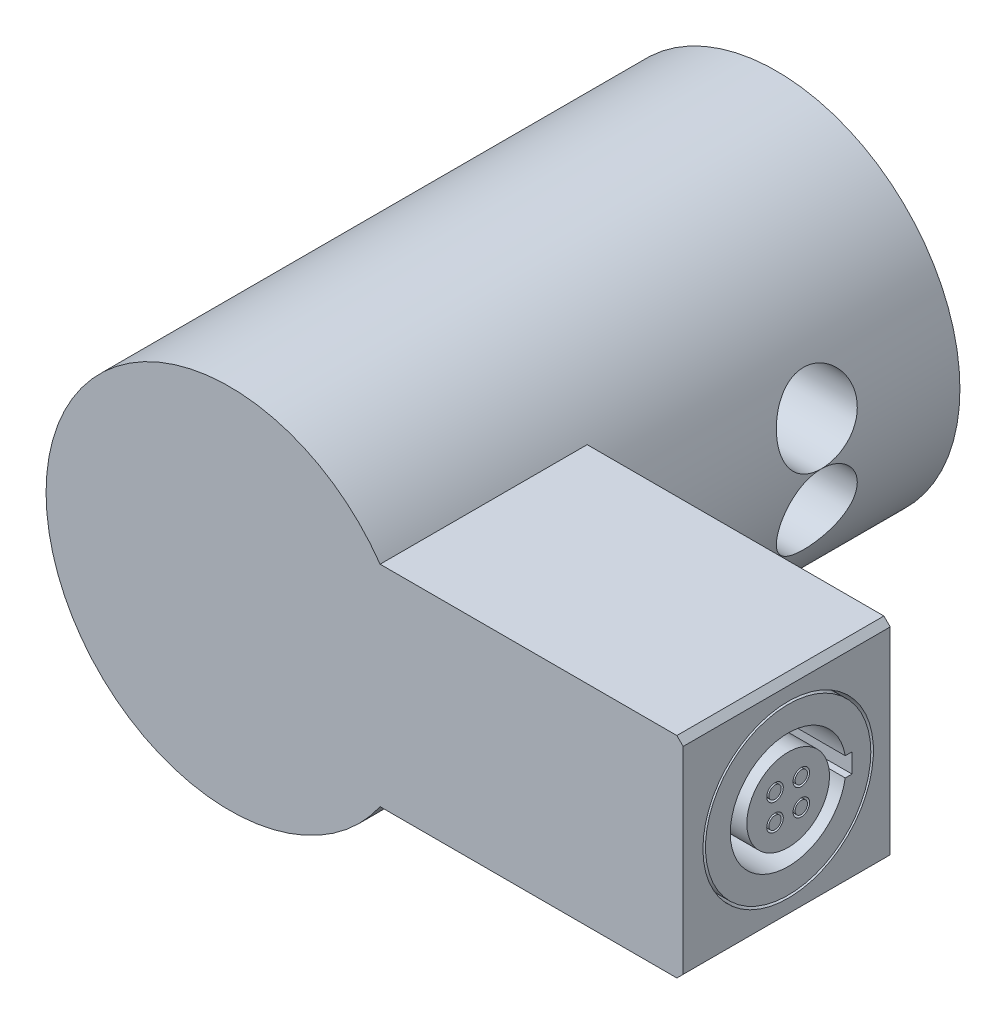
ISO-10303-21;
HEADER;
FILE_DESCRIPTION(('STEP AP214'),'2;1');
FILE_NAME('part.step','',(''),(''),'','','');
FILE_SCHEMA(('AUTOMOTIVE_DESIGN { 1 0 10303 214 1 1 1 1 }'));
ENDSEC;
DATA;
#1=APPLICATION_CONTEXT('core data for automotive mechanical design processes');
#2=APPLICATION_PROTOCOL_DEFINITION('international standard','automotive_design',2000,#1);
#3=PRODUCT_CONTEXT('',#1,'mechanical');
#4=PRODUCT('Part','Part','',(#3));
#5=PRODUCT_RELATED_PRODUCT_CATEGORY('part','',(#4));
#6=PRODUCT_DEFINITION_FORMATION('','',#4);
#7=PRODUCT_DEFINITION_CONTEXT('part definition',#1,'design');
#8=PRODUCT_DEFINITION('design','',#6,#7);
#9=PRODUCT_DEFINITION_SHAPE('','',#8);
#10=(LENGTH_UNIT() NAMED_UNIT(*) SI_UNIT(.MILLI.,.METRE.));
#11=(NAMED_UNIT(*) PLANE_ANGLE_UNIT() SI_UNIT($,.RADIAN.));
#12=(NAMED_UNIT(*) SI_UNIT($,.STERADIAN.) SOLID_ANGLE_UNIT());
#13=UNCERTAINTY_MEASURE_WITH_UNIT(LENGTH_MEASURE(1.E-05),#10,'distance_accuracy_value','');
#14=(GEOMETRIC_REPRESENTATION_CONTEXT(3) GLOBAL_UNCERTAINTY_ASSIGNED_CONTEXT((#13)) GLOBAL_UNIT_ASSIGNED_CONTEXT((#10,
#11,#12)) REPRESENTATION_CONTEXT('',''));
#15=CARTESIAN_POINT('',(0.,0.,0.));
#16=DIRECTION('',(0.,0.,1.));
#17=DIRECTION('',(1.,0.,0.));
#18=AXIS2_PLACEMENT_3D('',#15,#16,#17);
#19=CARTESIAN_POINT('',(-35.8486498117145,2.38870821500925,-24.6888));
#20=DIRECTION('',(1.,0.,0.));
#21=DIRECTION('',(0.,0.,-1.));
#22=AXIS2_PLACEMENT_3D('',#19,#20,#21);
#23=CONICAL_SURFACE('',#22,0.842117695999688,1.04740952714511);
#24=CARTESIAN_POINT('',(-36.3346087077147,2.38870821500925,-24.6888000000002));
#25=VERTEX_POINT('',#24);
#26=VERTEX_LOOP('',#25);
#27=FACE_BOUND('',#26,.T.);
#28=CARTESIAN_POINT('',(-35.8486498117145,2.38870821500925,-24.6888));
#29=DIRECTION('',(-1.,0.,0.));
#30=DIRECTION('',(0.,0.,1.));
#31=AXIS2_PLACEMENT_3D('',#28,#29,#30);
#32=CIRCLE('',#31,0.842117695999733);
#33=CARTESIAN_POINT('',(-35.8486498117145,2.38870821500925,-23.8466823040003));
#34=VERTEX_POINT('',#33);
#35=EDGE_CURVE('P0_E290',#34,#34,#32,.F.);
#36=ORIENTED_EDGE('',*,*,#35,.T.);
#37=EDGE_LOOP('',(#36));
#38=FACE_BOUND('',#37,.T.);
#39=ADVANCED_FACE('P0_F16',(#27,#38),#23,.F.);
#40=CARTESIAN_POINT('',(-35.8486498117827,-2.38870821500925,-24.6888));
#41=DIRECTION('',(1.,0.,0.));
#42=DIRECTION('',(0.,0.,-1.));
#43=AXIS2_PLACEMENT_3D('',#40,#41,#42);
#44=CONICAL_SURFACE('',#43,0.842117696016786,1.04740952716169);
#45=CARTESIAN_POINT('',(-36.3346087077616,-2.38870821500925,-24.6888));
#46=VERTEX_POINT('',#45);
#47=VERTEX_LOOP('',#46);
#48=FACE_BOUND('',#47,.T.);
#49=CARTESIAN_POINT('',(-35.8486498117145,-2.38870821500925,-24.6888));
#50=DIRECTION('',(1.,0.,0.));
#51=DIRECTION('',(0.,0.,-1.));
#52=AXIS2_PLACEMENT_3D('',#49,#50,#51);
#53=CIRCLE('',#52,0.842117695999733);
#54=CARTESIAN_POINT('',(-35.8486498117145,-2.38870821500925,-25.5309176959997));
#55=VERTEX_POINT('',#54);
#56=EDGE_CURVE('P0_E287',#55,#55,#53,.T.);
#57=ORIENTED_EDGE('',*,*,#56,.T.);
#58=EDGE_LOOP('',(#57));
#59=FACE_BOUND('',#58,.T.);
#60=ADVANCED_FACE('P0_F474',(#48,#59),#44,.F.);
#61=CARTESIAN_POINT('',(-37.8804224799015,2.38870821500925,-24.6888));
#62=DIRECTION('',(-1.,0.,0.));
#63=DIRECTION('',(0.,0.,1.));
#64=AXIS2_PLACEMENT_3D('',#61,#62,#63);
#65=CYLINDRICAL_SURFACE('',#64,0.842117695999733);
#66=CARTESIAN_POINT('',(-35.3025396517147,2.38870821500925,-24.6888));
#67=DIRECTION('',(-1.,0.,0.));
#68=DIRECTION('',(0.,0.,1.));
#69=AXIS2_PLACEMENT_3D('',#66,#67,#68);
#70=CIRCLE('',#69,0.842117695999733);
#71=CARTESIAN_POINT('',(-35.3025396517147,2.38870821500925,-23.8466823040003));
#72=VERTEX_POINT('',#71);
#73=EDGE_CURVE('P0_E19',#72,#72,#70,.F.);
#74=ORIENTED_EDGE('',*,*,#73,.T.);
#75=EDGE_LOOP('',(#74));
#76=FACE_BOUND('',#75,.T.);
#77=ORIENTED_EDGE('',*,*,#35,.F.);
#78=EDGE_LOOP('',(#77));
#79=FACE_BOUND('',#78,.T.);
#80=ADVANCED_FACE('P0_F386',(#76,#79),#65,.F.);
#81=CARTESIAN_POINT('',(-37.8804224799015,-2.38870821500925,-24.6888));
#82=DIRECTION('',(1.,0.,0.));
#83=DIRECTION('',(0.,0.,-1.));
#84=AXIS2_PLACEMENT_3D('',#81,#82,#83);
#85=CYLINDRICAL_SURFACE('',#84,0.842117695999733);
#86=ORIENTED_EDGE('',*,*,#56,.F.);
#87=EDGE_LOOP('',(#86));
#88=FACE_BOUND('',#87,.T.);
#89=CARTESIAN_POINT('',(-35.3025396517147,-2.38870821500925,-24.6888));
#90=DIRECTION('',(1.,0.,0.));
#91=DIRECTION('',(0.,0.,-1.));
#92=AXIS2_PLACEMENT_3D('',#89,#90,#91);
#93=CIRCLE('',#92,0.842117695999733);
#94=CARTESIAN_POINT('',(-35.3025396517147,-2.38870821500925,-25.5309176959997));
#95=VERTEX_POINT('',#94);
#96=EDGE_CURVE('P0_E286',#95,#95,#93,.T.);
#97=ORIENTED_EDGE('',*,*,#96,.T.);
#98=EDGE_LOOP('',(#97));
#99=FACE_BOUND('',#98,.T.);
#100=ADVANCED_FACE('P0_F468',(#88,#99),#85,.F.);
#101=CARTESIAN_POINT('',(29.568,0.,-6.35));
#102=DIRECTION('',(-1.,0.,0.));
#103=DIRECTION('',(0.,0.,1.));
#104=AXIS2_PLACEMENT_3D('',#101,#102,#103);
#105=CYLINDRICAL_SURFACE('',#104,4.4958000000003);
#106=CARTESIAN_POINT('',(-1.5748,0.,-6.35));
#107=DIRECTION('',(-1.,0.,0.));
#108=DIRECTION('',(0.,0.,1.));
#109=AXIS2_PLACEMENT_3D('',#106,#107,#108);
#110=CIRCLE('',#109,4.4958000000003);
#111=CARTESIAN_POINT('',(-1.5748,0.,-1.8541999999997));
#112=VERTEX_POINT('',#111);
#113=EDGE_CURVE('P0_E285',#112,#112,#110,.F.);
#114=ORIENTED_EDGE('',*,*,#113,.T.);
#115=EDGE_LOOP('',(#114));
#116=FACE_BOUND('',#115,.T.);
#117=CARTESIAN_POINT('',(-13.0048000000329,0.,-6.35));
#118=DIRECTION('',(1.,0.,0.));
#119=DIRECTION('',(0.,0.,-1.));
#120=AXIS2_PLACEMENT_3D('',#117,#118,#119);
#121=CIRCLE('',#120,4.49580000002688);
#122=CARTESIAN_POINT('',(-13.0048000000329,0.,-10.8458000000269));
#123=VERTEX_POINT('',#122);
#124=EDGE_CURVE('P0_E282',#123,#123,#121,.F.);
#125=ORIENTED_EDGE('',*,*,#124,.T.);
#126=EDGE_LOOP('',(#125));
#127=FACE_BOUND('',#126,.T.);
#128=ADVANCED_FACE('P0_F393',(#116,#127),#105,.F.);
#129=CARTESIAN_POINT('',(-35.3025396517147,1.29648789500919,-24.6888));
#130=DIRECTION('',(-1.,0.,0.));
#131=DIRECTION('',(0.,0.,1.));
#132=AXIS2_PLACEMENT_3D('',#129,#130,#131);
#133=PLANE('',#132);
#134=ORIENTED_EDGE('',*,*,#73,.F.);
#135=EDGE_LOOP('',(#134));
#136=FACE_BOUND('',#135,.T.);
#137=CARTESIAN_POINT('',(-35.3025396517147,2.38870821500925,-24.6888));
#138=DIRECTION('',(-1.,0.,0.));
#139=DIRECTION('',(0.,0.,1.));
#140=AXIS2_PLACEMENT_3D('',#137,#138,#139);
#141=CIRCLE('',#140,1.09222032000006);
#142=CARTESIAN_POINT('',(-35.3025396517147,2.38870821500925,-23.5965796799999));
#143=VERTEX_POINT('',#142);
#144=EDGE_CURVE('P0_E376',#143,#143,#141,.F.);
#145=ORIENTED_EDGE('',*,*,#144,.T.);
#146=EDGE_LOOP('',(#145));
#147=FACE_BOUND('',#146,.T.);
#148=ADVANCED_FACE('P0_F389',(#136,#147),#133,.F.);
#149=CARTESIAN_POINT('',(-35.3025396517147,-1.29648789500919,-24.6888));
#150=DIRECTION('',(-1.,0.,0.));
#151=DIRECTION('',(0.,0.,1.));
#152=AXIS2_PLACEMENT_3D('',#149,#150,#151);
#153=PLANE('',#152);
#154=CARTESIAN_POINT('',(-35.3025396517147,-2.38870821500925,-24.6888));
#155=DIRECTION('',(1.,0.,0.));
#156=DIRECTION('',(0.,0.,-1.));
#157=AXIS2_PLACEMENT_3D('',#154,#155,#156);
#158=CIRCLE('',#157,1.09222032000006);
#159=CARTESIAN_POINT('',(-35.3025396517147,-2.38870821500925,-25.7810203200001));
#160=VERTEX_POINT('',#159);
#161=EDGE_CURVE('P0_E277',#160,#160,#158,.T.);
#162=ORIENTED_EDGE('',*,*,#161,.T.);
#163=EDGE_LOOP('',(#162));
#164=FACE_BOUND('',#163,.T.);
#165=ORIENTED_EDGE('',*,*,#96,.F.);
#166=EDGE_LOOP('',(#165));
#167=FACE_BOUND('',#166,.T.);
#168=ADVANCED_FACE('P0_F392',(#164,#167),#153,.F.);
#169=CARTESIAN_POINT('',(-31.4198000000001,0.,-6.35));
#170=DIRECTION('',(1.,0.,0.));
#171=DIRECTION('',(0.,0.,-1.));
#172=AXIS2_PLACEMENT_3D('',#169,#170,#171);
#173=CONICAL_SURFACE('',#172,3.98779999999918,1.03601586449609);
#174=CARTESIAN_POINT('',(-33.7820000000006,0.,-6.34999999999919));
#175=VERTEX_POINT('',#174);
#176=VERTEX_LOOP('',#175);
#177=FACE_BOUND('',#176,.T.);
#178=CARTESIAN_POINT('',(-31.4197999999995,0.,-6.35));
#179=DIRECTION('',(-1.,0.,0.));
#180=DIRECTION('',(0.,0.,1.));
#181=AXIS2_PLACEMENT_3D('',#178,#179,#180);
#182=CIRCLE('',#181,3.98779999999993);
#183=CARTESIAN_POINT('',(-31.4197999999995,0.,-2.36220000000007));
#184=VERTEX_POINT('',#183);
#185=EDGE_CURVE('P0_E275',#184,#184,#182,.F.);
#186=ORIENTED_EDGE('',*,*,#185,.T.);
#187=EDGE_LOOP('',(#186));
#188=FACE_BOUND('',#187,.T.);
#189=ADVANCED_FACE('P0_F459',(#177,#188),#173,.F.);
#190=CARTESIAN_POINT('',(-13.0048000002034,0.,-6.35));
#191=DIRECTION('',(1.,0.,0.));
#192=DIRECTION('',(0.,0.,-1.));
#193=AXIS2_PLACEMENT_3D('',#190,#191,#192);
#194=CONICAL_SURFACE('',#193,4.4957999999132,0.656547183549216);
#195=ORIENTED_EDGE('',*,*,#124,.F.);
#196=EDGE_LOOP('',(#195));
#197=FACE_BOUND('',#196,.T.);
#198=CARTESIAN_POINT('',(-13.6640376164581,0.,-6.35));
#199=DIRECTION('',(-1.,0.,0.));
#200=DIRECTION('',(0.,0.,1.));
#201=AXIS2_PLACEMENT_3D('',#198,#199,#200);
#202=CIRCLE('',#201,3.98779999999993);
#203=CARTESIAN_POINT('',(-13.6640376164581,0.,-2.36220000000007));
#204=VERTEX_POINT('',#203);
#205=EDGE_CURVE('P0_E268',#204,#204,#202,.T.);
#206=ORIENTED_EDGE('',*,*,#205,.T.);
#207=EDGE_LOOP('',(#206));
#208=FACE_BOUND('',#207,.T.);
#209=ADVANCED_FACE('P0_F455',(#197,#208),#194,.F.);
#210=CARTESIAN_POINT('',(-1.5748,-4.49580000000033,-6.35));
#211=DIRECTION('',(-1.,0.,0.));
#212=DIRECTION('',(0.,0.,1.));
#213=AXIS2_PLACEMENT_3D('',#210,#211,#212);
#214=PLANE('',#213);
#215=ORIENTED_EDGE('',*,*,#113,.F.);
#216=EDGE_LOOP('',(#215));
#217=FACE_BOUND('',#216,.T.);
#218=CARTESIAN_POINT('',(-1.5748,0.,-6.35));
#219=DIRECTION('',(-1.,0.,0.));
#220=DIRECTION('',(0.,0.,1.));
#221=AXIS2_PLACEMENT_3D('',#218,#219,#220);
#222=CIRCLE('',#221,5.15620000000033);
#223=CARTESIAN_POINT('',(-1.5748,0.,-1.19379999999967));
#224=VERTEX_POINT('',#223);
#225=EDGE_CURVE('P0_E257',#224,#224,#222,.F.);
#226=ORIENTED_EDGE('',*,*,#225,.T.);
#227=EDGE_LOOP('',(#226));
#228=FACE_BOUND('',#227,.T.);
#229=ADVANCED_FACE('P0_F401',(#217,#228),#214,.F.);
#230=CARTESIAN_POINT('',(-37.8804224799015,2.38870821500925,-24.6888));
#231=DIRECTION('',(-1.,0.,0.));
#232=DIRECTION('',(0.,0.,1.));
#233=AXIS2_PLACEMENT_3D('',#230,#231,#232);
#234=CYLINDRICAL_SURFACE('',#233,1.09222032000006);
#235=ORIENTED_EDGE('',*,*,#144,.F.);
#236=EDGE_LOOP('',(#235));
#237=FACE_BOUND('',#236,.T.);
#238=CARTESIAN_POINT('',(-30.2259999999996,2.38870821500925,-24.6888));
#239=DIRECTION('',(-1.,0.,0.));
#240=DIRECTION('',(0.,0.,1.));
#241=AXIS2_PLACEMENT_3D('',#238,#239,#240);
#242=CIRCLE('',#241,1.09222032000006);
#243=CARTESIAN_POINT('',(-30.2259999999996,2.38870821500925,-23.5965796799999));
#244=VERTEX_POINT('',#243);
#245=EDGE_CURVE('P0_E368',#244,#244,#242,.T.);
#246=ORIENTED_EDGE('',*,*,#245,.F.);
#247=EDGE_LOOP('',(#246));
#248=FACE_BOUND('',#247,.T.);
#249=ADVANCED_FACE('P0_F397',(#237,#248),#234,.F.);
#250=CARTESIAN_POINT('',(-37.8804224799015,-2.38870821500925,-24.6888));
#251=DIRECTION('',(1.,0.,0.));
#252=DIRECTION('',(0.,0.,-1.));
#253=AXIS2_PLACEMENT_3D('',#250,#251,#252);
#254=CYLINDRICAL_SURFACE('',#253,1.09222032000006);
#255=CARTESIAN_POINT('',(-30.2259999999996,-2.38870821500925,-24.6888));
#256=DIRECTION('',(1.,0.,0.));
#257=DIRECTION('',(0.,0.,-1.));
#258=AXIS2_PLACEMENT_3D('',#255,#256,#257);
#259=CIRCLE('',#258,1.09222032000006);
#260=CARTESIAN_POINT('',(-30.2259999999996,-2.38870821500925,-25.7810203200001));
#261=VERTEX_POINT('',#260);
#262=EDGE_CURVE('P0_E245',#261,#261,#259,.F.);
#263=ORIENTED_EDGE('',*,*,#262,.F.);
#264=EDGE_LOOP('',(#263));
#265=FACE_BOUND('',#264,.T.);
#266=ORIENTED_EDGE('',*,*,#161,.F.);
#267=EDGE_LOOP('',(#266));
#268=FACE_BOUND('',#267,.T.);
#269=ADVANCED_FACE('P0_F400',(#265,#268),#254,.F.);
#270=CARTESIAN_POINT('',(-27.0255999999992,9.52389178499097,-9.4488));
#271=DIRECTION('',(-2.73184799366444E-13,-1.,0.));
#272=DIRECTION('',(1.,-2.73184799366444E-13,0.));
#273=AXIS2_PLACEMENT_3D('',#270,#271,#272);
#274=PLANE('',#273);
#275=DIRECTION('',(1.,0.,0.));
#276=VECTOR('',#275,1.);
#277=CARTESIAN_POINT('',(-27.0255999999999,9.52389178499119,-9.4488));
#278=LINE('',#277,#276);
#279=CARTESIAN_POINT('',(-27.0255999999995,9.52389178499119,-9.4488));
#280=VERTEX_POINT('',#279);
#281=CARTESIAN_POINT('',(-27.8383999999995,9.52389178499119,-9.4488));
#282=VERTEX_POINT('',#281);
#283=EDGE_CURVE('P0_E269',#280,#282,#278,.F.);
#284=ORIENTED_EDGE('',*,*,#283,.T.);
#285=DIRECTION('',(0.,0.,-1.));
#286=VECTOR('',#285,1.);
#287=CARTESIAN_POINT('',(-27.8383999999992,9.52389178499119,-9.4488));
#288=LINE('',#287,#286);
#289=CARTESIAN_POINT('',(-27.8383999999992,9.52389178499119,-33.0708));
#290=VERTEX_POINT('',#289);
#291=EDGE_CURVE('P0_E230',#282,#290,#288,.T.);
#292=ORIENTED_EDGE('',*,*,#291,.T.);
#293=DIRECTION('',(1.,-2.73184799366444E-13,0.));
#294=VECTOR('',#293,1.);
#295=CARTESIAN_POINT('',(-27.0255999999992,9.52389178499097,-33.0708));
#296=LINE('',#295,#294);
#297=CARTESIAN_POINT('',(-27.0255999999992,9.52389178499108,-33.0708));
#298=VERTEX_POINT('',#297);
#299=EDGE_CURVE('P0_E272',#290,#298,#296,.T.);
#300=ORIENTED_EDGE('',*,*,#299,.T.);
#301=DIRECTION('',(0.,0.,-1.));
#302=VECTOR('',#301,1.);
#303=CARTESIAN_POINT('',(-27.0255999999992,9.52389178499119,-9.4488));
#304=LINE('',#303,#302);
#305=EDGE_CURVE('P0_E228',#298,#280,#304,.F.);
#306=ORIENTED_EDGE('',*,*,#305,.T.);
#307=EDGE_LOOP('',(#284,#292,#300,#306));
#308=FACE_BOUND('',#307,.T.);
#309=ADVANCED_FACE('P0_F445',(#308),#274,.T.);
#310=CARTESIAN_POINT('',(-27.0255999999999,-7.13850821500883,-9.4488));
#311=DIRECTION('',(0.,0.,1.));
#312=DIRECTION('',(1.,0.,0.));
#313=AXIS2_PLACEMENT_3D('',#310,#311,#312);
#314=PLANE('',#313);
#315=DIRECTION('',(1.,0.,0.));
#316=VECTOR('',#315,1.);
#317=CARTESIAN_POINT('',(-27.0255999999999,2.50997756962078,-9.4488));
#318=LINE('',#317,#316);
#319=CARTESIAN_POINT('',(-30.2259999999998,2.50997756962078,-9.4488));
#320=VERTEX_POINT('',#319);
#321=CARTESIAN_POINT('',(-24.6379999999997,2.50997756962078,-9.4488));
#322=VERTEX_POINT('',#321);
#323=EDGE_CURVE('P0_E271',#320,#322,#318,.T.);
#324=ORIENTED_EDGE('',*,*,#323,.F.);
#325=DIRECTION('',(0.,1.,0.));
#326=VECTOR('',#325,1.);
#327=CARTESIAN_POINT('',(-30.2259999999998,-7.13850821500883,-9.4488));
#328=LINE('',#327,#326);
#329=CARTESIAN_POINT('',(-30.2259999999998,7.13629178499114,-9.4488));
#330=VERTEX_POINT('',#329);
#331=EDGE_CURVE('P0_E238',#330,#320,#328,.F.);
#332=ORIENTED_EDGE('',*,*,#331,.F.);
#333=CARTESIAN_POINT('',(-27.8383999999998,7.13629178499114,-9.4488));
#334=DIRECTION('',(0.,0.,-1.));
#335=DIRECTION('',(-1.,0.,0.));
#336=AXIS2_PLACEMENT_3D('',#333,#334,#335);
#337=CIRCLE('',#336,2.38760000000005);
#338=EDGE_CURVE('P0_E233',#330,#282,#337,.T.);
#339=ORIENTED_EDGE('',*,*,#338,.T.);
#340=ORIENTED_EDGE('',*,*,#283,.F.);
#341=CARTESIAN_POINT('',(-27.0255999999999,7.13629178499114,-9.4488));
#342=DIRECTION('',(0.,0.,-1.));
#343=DIRECTION('',(-1.,0.,0.));
#344=AXIS2_PLACEMENT_3D('',#341,#342,#343);
#345=CIRCLE('',#344,2.38760000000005);
#346=CARTESIAN_POINT('',(-24.6379999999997,7.13629178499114,-9.4488));
#347=VERTEX_POINT('',#346);
#348=EDGE_CURVE('P0_E225',#280,#347,#345,.T.);
#349=ORIENTED_EDGE('',*,*,#348,.T.);
#350=DIRECTION('',(0.,1.,0.));
#351=VECTOR('',#350,1.);
#352=CARTESIAN_POINT('',(-24.6379999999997,-7.13850821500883,-9.4488));
#353=LINE('',#352,#351);
#354=EDGE_CURVE('P0_E222',#322,#347,#353,.T.);
#355=ORIENTED_EDGE('',*,*,#354,.F.);
#356=EDGE_LOOP('',(#324,#332,#339,#340,#349,#355));
#357=FACE_BOUND('',#356,.T.);
#358=ADVANCED_FACE('P0_F441',(#357),#314,.F.);
#359=CARTESIAN_POINT('',(29.568,0.,-6.35));
#360=DIRECTION('',(-1.,0.,0.));
#361=DIRECTION('',(0.,0.,1.));
#362=AXIS2_PLACEMENT_3D('',#359,#360,#361);
#363=CYLINDRICAL_SURFACE('',#362,3.98779999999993);
#364=ORIENTED_EDGE('',*,*,#185,.F.);
#365=EDGE_LOOP('',(#364));
#366=FACE_BOUND('',#365,.T.);
#367=DIRECTION('',(1.,0.,0.));
#368=VECTOR('',#367,1.);
#369=CARTESIAN_POINT('',(-27.0255999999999,-2.50997756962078,-9.4488));
#370=LINE('',#369,#368);
#371=CARTESIAN_POINT('',(-24.6379999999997,-2.50997756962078,-9.4488));
#372=VERTEX_POINT('',#371);
#373=CARTESIAN_POINT('',(-30.2259999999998,-2.50997756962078,-9.4488));
#374=VERTEX_POINT('',#373);
#375=EDGE_CURVE('P0_E264',#372,#374,#370,.F.);
#376=ORIENTED_EDGE('',*,*,#375,.T.);
#377=CARTESIAN_POINT('',(-30.2259999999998,0.,-6.35));
#378=DIRECTION('',(-1.,0.,0.));
#379=DIRECTION('',(0.,0.,1.));
#380=AXIS2_PLACEMENT_3D('',#377,#378,#379);
#381=CIRCLE('',#380,3.98779999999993);
#382=EDGE_CURVE('P0_E237',#320,#374,#381,.T.);
#383=ORIENTED_EDGE('',*,*,#382,.F.);
#384=ORIENTED_EDGE('',*,*,#323,.T.);
#385=CARTESIAN_POINT('',(-24.6379999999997,0.,-6.35));
#386=DIRECTION('',(-1.,0.,0.));
#387=DIRECTION('',(0.,0.,1.));
#388=AXIS2_PLACEMENT_3D('',#385,#386,#387);
#389=CIRCLE('',#388,3.98779999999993);
#390=EDGE_CURVE('P0_E217',#372,#322,#389,.F.);
#391=ORIENTED_EDGE('',*,*,#390,.F.);
#392=EDGE_LOOP('',(#376,#383,#384,#391));
#393=FACE_BOUND('',#392,.T.);
#394=ORIENTED_EDGE('',*,*,#205,.F.);
#395=EDGE_LOOP('',(#394));
#396=FACE_BOUND('',#395,.T.);
#397=ADVANCED_FACE('P0_F438',(#366,#393,#396),#363,.F.);
#398=CARTESIAN_POINT('',(-27.0255999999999,-7.13850821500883,-9.4488));
#399=DIRECTION('',(0.,0.,1.));
#400=DIRECTION('',(1.,0.,0.));
#401=AXIS2_PLACEMENT_3D('',#398,#399,#400);
#402=PLANE('',#401);
#403=ORIENTED_EDGE('',*,*,#375,.F.);
#404=DIRECTION('',(0.,1.,0.));
#405=VECTOR('',#404,1.);
#406=CARTESIAN_POINT('',(-24.6379999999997,-7.13850821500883,-9.4488));
#407=LINE('',#406,#405);
#408=CARTESIAN_POINT('',(-24.6379999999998,-7.13850821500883,-9.4488));
#409=VERTEX_POINT('',#408);
#410=EDGE_CURVE('P0_E218',#409,#372,#407,.T.);
#411=ORIENTED_EDGE('',*,*,#410,.F.);
#412=CARTESIAN_POINT('',(-27.0255999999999,-7.13850821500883,-9.4488));
#413=DIRECTION('',(0.,0.,-1.));
#414=DIRECTION('',(-1.,0.,0.));
#415=AXIS2_PLACEMENT_3D('',#412,#413,#414);
#416=CIRCLE('',#415,2.3876);
#417=CARTESIAN_POINT('',(-27.0256000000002,-9.5261082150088,-9.4488));
#418=VERTEX_POINT('',#417);
#419=EDGE_CURVE('P0_E213',#409,#418,#416,.T.);
#420=ORIENTED_EDGE('',*,*,#419,.T.);
#421=DIRECTION('',(-1.,1.36592399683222E-13,0.));
#422=VECTOR('',#421,1.);
#423=CARTESIAN_POINT('',(-27.0256000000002,-9.52610821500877,-9.4488));
#424=LINE('',#423,#422);
#425=CARTESIAN_POINT('',(-27.8384000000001,-9.52610821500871,-9.4488));
#426=VERTEX_POINT('',#425);
#427=EDGE_CURVE('P0_E108',#426,#418,#424,.F.);
#428=ORIENTED_EDGE('',*,*,#427,.F.);
#429=CARTESIAN_POINT('',(-27.8383999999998,-7.13850821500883,-9.4488));
#430=DIRECTION('',(0.,0.,-1.));
#431=DIRECTION('',(-1.,0.,0.));
#432=AXIS2_PLACEMENT_3D('',#429,#430,#431);
#433=CIRCLE('',#432,2.38759999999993);
#434=CARTESIAN_POINT('',(-30.2259999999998,-7.13850821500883,-9.4488));
#435=VERTEX_POINT('',#434);
#436=EDGE_CURVE('P0_E250',#426,#435,#433,.T.);
#437=ORIENTED_EDGE('',*,*,#436,.T.);
#438=DIRECTION('',(0.,1.,0.));
#439=VECTOR('',#438,1.);
#440=CARTESIAN_POINT('',(-30.2259999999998,-7.13850821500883,-9.4488));
#441=LINE('',#440,#439);
#442=EDGE_CURVE('P0_E242',#374,#435,#441,.F.);
#443=ORIENTED_EDGE('',*,*,#442,.F.);
#444=EDGE_LOOP('',(#403,#411,#420,#428,#437,#443));
#445=FACE_BOUND('',#444,.T.);
#446=ADVANCED_FACE('P0_F434',(#445),#402,.F.);
#447=CARTESIAN_POINT('',(-27.0256000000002,-9.52610821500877,-9.4488));
#448=DIRECTION('',(1.36592399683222E-13,1.,0.));
#449=DIRECTION('',(-1.,1.36592399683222E-13,0.));
#450=AXIS2_PLACEMENT_3D('',#447,#448,#449);
#451=PLANE('',#450);
#452=ORIENTED_EDGE('',*,*,#427,.T.);
#453=DIRECTION('',(0.,0.,-1.));
#454=VECTOR('',#453,1.);
#455=CARTESIAN_POINT('',(-27.0256000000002,-9.52610821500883,-9.4488));
#456=LINE('',#455,#454);
#457=CARTESIAN_POINT('',(-27.0256000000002,-9.5261082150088,-33.0708));
#458=VERTEX_POINT('',#457);
#459=EDGE_CURVE('P0_E197',#418,#458,#456,.T.);
#460=ORIENTED_EDGE('',*,*,#459,.T.);
#461=DIRECTION('',(-1.,1.36592399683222E-13,0.));
#462=VECTOR('',#461,1.);
#463=CARTESIAN_POINT('',(-27.0256000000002,-9.52610821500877,-33.0708));
#464=LINE('',#463,#462);
#465=CARTESIAN_POINT('',(-27.8384000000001,-9.52610821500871,-33.0708));
#466=VERTEX_POINT('',#465);
#467=EDGE_CURVE('P0_E262',#458,#466,#464,.T.);
#468=ORIENTED_EDGE('',*,*,#467,.T.);
#469=DIRECTION('',(0.,0.,-1.));
#470=VECTOR('',#469,1.);
#471=CARTESIAN_POINT('',(-27.8384000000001,-9.52610821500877,-9.4488));
#472=LINE('',#471,#470);
#473=EDGE_CURVE('P0_E248',#466,#426,#472,.F.);
#474=ORIENTED_EDGE('',*,*,#473,.T.);
#475=EDGE_LOOP('',(#452,#460,#468,#474));
#476=FACE_BOUND('',#475,.T.);
#477=ADVANCED_FACE('P0_F430',(#476),#451,.T.);
#478=CARTESIAN_POINT('',(29.568,0.,-6.35));
#479=DIRECTION('',(-1.,0.,0.));
#480=DIRECTION('',(0.,0.,1.));
#481=AXIS2_PLACEMENT_3D('',#478,#479,#480);
#482=CYLINDRICAL_SURFACE('',#481,5.15620000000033);
#483=CARTESIAN_POINT('',(0.,0.,-6.35));
#484=DIRECTION('',(-1.,0.,0.));
#485=DIRECTION('',(0.,0.,1.));
#486=AXIS2_PLACEMENT_3D('',#483,#484,#485);
#487=CIRCLE('',#486,5.15620000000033);
#488=CARTESIAN_POINT('',(0.,0.,-1.19379999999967));
#489=VERTEX_POINT('',#488);
#490=EDGE_CURVE('P0_E196',#489,#489,#487,.F.);
#491=ORIENTED_EDGE('',*,*,#490,.T.);
#492=EDGE_LOOP('',(#491));
#493=FACE_BOUND('',#492,.T.);
#494=ORIENTED_EDGE('',*,*,#225,.F.);
#495=EDGE_LOOP('',(#494));
#496=FACE_BOUND('',#495,.T.);
#497=ADVANCED_FACE('P0_F426',(#493,#496),#482,.F.);
#498=CARTESIAN_POINT('',(-0.381000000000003,-6.35,-12.5222));
#499=DIRECTION('',(-0.707106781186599,0.707106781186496,0.));
#500=DIRECTION('',(-0.707106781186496,-0.707106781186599,0.));
#501=AXIS2_PLACEMENT_3D('',#498,#499,#500);
#502=PLANE('',#501);
#503=DIRECTION('',(0.,0.,1.));
#504=VECTOR('',#503,1.);
#505=CARTESIAN_POINT('',(-0.381000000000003,-6.35,-12.5222));
#506=LINE('',#505,#504);
#507=CARTESIAN_POINT('',(-0.381,-6.35,0.));
#508=VERTEX_POINT('',#507);
#509=CARTESIAN_POINT('',(-0.381000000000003,-6.35,-12.5222));
#510=VERTEX_POINT('',#509);
#511=EDGE_CURVE('P0_E184',#508,#510,#506,.F.);
#512=ORIENTED_EDGE('',*,*,#511,.T.);
#513=DIRECTION('',(-0.707106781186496,-0.707106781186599,0.));
#514=VECTOR('',#513,1.);
#515=CARTESIAN_POINT('',(-0.381000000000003,-6.35,-12.5222));
#516=LINE('',#515,#514);
#517=CARTESIAN_POINT('',(0.,-5.96899999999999,-12.5222));
#518=VERTEX_POINT('',#517);
#519=EDGE_CURVE('P0_E253',#518,#510,#516,.T.);
#520=ORIENTED_EDGE('',*,*,#519,.F.);
#521=DIRECTION('',(0.,0.,1.));
#522=VECTOR('',#521,1.);
#523=CARTESIAN_POINT('',(0.,-5.969,-12.5222));
#524=LINE('',#523,#522);
#525=CARTESIAN_POINT('',(0.,-5.96899999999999,0.));
#526=VERTEX_POINT('',#525);
#527=EDGE_CURVE('P0_E188',#518,#526,#524,.T.);
#528=ORIENTED_EDGE('',*,*,#527,.T.);
#529=DIRECTION('',(-0.707106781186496,-0.707106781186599,0.));
#530=VECTOR('',#529,1.);
#531=CARTESIAN_POINT('',(-0.381000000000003,-6.35,0.));
#532=LINE('',#531,#530);
#533=EDGE_CURVE('P0_E251',#508,#526,#532,.F.);
#534=ORIENTED_EDGE('',*,*,#533,.F.);
#535=EDGE_LOOP('',(#512,#520,#528,#534));
#536=FACE_BOUND('',#535,.T.);
#537=ADVANCED_FACE('P0_F418',(#536),#502,.F.);
#538=CARTESIAN_POINT('',(-27.8383999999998,-7.13850821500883,-9.4488));
#539=DIRECTION('',(0.,0.,-1.));
#540=DIRECTION('',(-1.,0.,0.));
#541=AXIS2_PLACEMENT_3D('',#538,#539,#540);
#542=CYLINDRICAL_SURFACE('',#541,2.38759999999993);
#543=DIRECTION('',(0.,0.,-1.));
#544=VECTOR('',#543,1.);
#545=CARTESIAN_POINT('',(-30.2259999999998,-7.13850821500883,-9.4488));
#546=LINE('',#545,#544);
#547=CARTESIAN_POINT('',(-30.2259999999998,-7.13850821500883,-33.0708));
#548=VERTEX_POINT('',#547);
#549=EDGE_CURVE('P0_E241',#435,#548,#546,.T.);
#550=ORIENTED_EDGE('',*,*,#549,.F.);
#551=ORIENTED_EDGE('',*,*,#436,.F.);
#552=ORIENTED_EDGE('',*,*,#473,.F.);
#553=CARTESIAN_POINT('',(-27.8383999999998,-7.13850821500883,-33.0708));
#554=DIRECTION('',(0.,0.,-1.));
#555=DIRECTION('',(-1.,0.,0.));
#556=AXIS2_PLACEMENT_3D('',#553,#554,#555);
#557=CIRCLE('',#556,2.38759999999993);
#558=EDGE_CURVE('P0_E178',#466,#548,#557,.T.);
#559=ORIENTED_EDGE('',*,*,#558,.T.);
#560=EDGE_LOOP('',(#550,#551,#552,#559));
#561=FACE_BOUND('',#560,.T.);
#562=ADVANCED_FACE('P0_F408',(#561),#542,.F.);
#563=CARTESIAN_POINT('',(-30.2259999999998,-7.13850821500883,-9.4488));
#564=DIRECTION('',(1.,0.,0.));
#565=DIRECTION('',(0.,0.,-1.));
#566=AXIS2_PLACEMENT_3D('',#563,#564,#565);
#567=PLANE('',#566);
#568=ORIENTED_EDGE('',*,*,#331,.T.);
#569=ORIENTED_EDGE('',*,*,#382,.T.);
#570=ORIENTED_EDGE('',*,*,#442,.T.);
#571=ORIENTED_EDGE('',*,*,#549,.T.);
#572=DIRECTION('',(0.,1.,0.));
#573=VECTOR('',#572,1.);
#574=CARTESIAN_POINT('',(-30.2259999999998,0.,-33.0708));
#575=LINE('',#574,#573);
#576=CARTESIAN_POINT('',(-30.2259999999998,7.13629178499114,-33.0708));
#577=VERTEX_POINT('',#576);
#578=EDGE_CURVE('P0_E175',#548,#577,#575,.T.);
#579=ORIENTED_EDGE('',*,*,#578,.T.);
#580=DIRECTION('',(0.,0.,-1.));
#581=VECTOR('',#580,1.);
#582=CARTESIAN_POINT('',(-30.2259999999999,7.13629178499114,-9.4488));
#583=LINE('',#582,#581);
#584=EDGE_CURVE('P0_E234',#577,#330,#583,.F.);
#585=ORIENTED_EDGE('',*,*,#584,.T.);
#586=EDGE_LOOP('',(#568,#569,#570,#571,#579,#585));
#587=FACE_BOUND('',#586,.T.);
#588=ORIENTED_EDGE('',*,*,#262,.T.);
#589=EDGE_LOOP('',(#588));
#590=FACE_BOUND('',#589,.T.);
#591=ORIENTED_EDGE('',*,*,#245,.T.);
#592=EDGE_LOOP('',(#591));
#593=FACE_BOUND('',#592,.T.);
#594=ADVANCED_FACE('P0_F405',(#587,#590,#593),#567,.T.);
#595=CARTESIAN_POINT('',(-27.8383999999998,7.13629178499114,-9.4488));
#596=DIRECTION('',(0.,0.,-1.));
#597=DIRECTION('',(-1.,0.,0.));
#598=AXIS2_PLACEMENT_3D('',#595,#596,#597);
#599=CYLINDRICAL_SURFACE('',#598,2.38760000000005);
#600=ORIENTED_EDGE('',*,*,#291,.F.);
#601=ORIENTED_EDGE('',*,*,#338,.F.);
#602=ORIENTED_EDGE('',*,*,#584,.F.);
#603=CARTESIAN_POINT('',(-27.8383999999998,7.13629178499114,-33.0708));
#604=DIRECTION('',(0.,0.,-1.));
#605=DIRECTION('',(-1.,0.,0.));
#606=AXIS2_PLACEMENT_3D('',#603,#604,#605);
#607=CIRCLE('',#606,2.38760000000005);
#608=EDGE_CURVE('P0_E177',#577,#290,#607,.T.);
#609=ORIENTED_EDGE('',*,*,#608,.T.);
#610=EDGE_LOOP('',(#600,#601,#602,#609));
#611=FACE_BOUND('',#610,.T.);
#612=ADVANCED_FACE('P0_F407',(#611),#599,.F.);
#613=CARTESIAN_POINT('',(-27.0255999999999,7.13629178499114,-9.4488));
#614=DIRECTION('',(0.,0.,-1.));
#615=DIRECTION('',(-1.,0.,0.));
#616=AXIS2_PLACEMENT_3D('',#613,#614,#615);
#617=CYLINDRICAL_SURFACE('',#616,2.38760000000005);
#618=DIRECTION('',(0.,0.,1.));
#619=VECTOR('',#618,1.);
#620=CARTESIAN_POINT('',(-24.6379999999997,7.13629178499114,-9.4488));
#621=LINE('',#620,#619);
#622=CARTESIAN_POINT('',(-24.6379999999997,7.13629178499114,-33.0708));
#623=VERTEX_POINT('',#622);
#624=EDGE_CURVE('P0_E221',#347,#623,#621,.F.);
#625=ORIENTED_EDGE('',*,*,#624,.F.);
#626=ORIENTED_EDGE('',*,*,#348,.F.);
#627=ORIENTED_EDGE('',*,*,#305,.F.);
#628=CARTESIAN_POINT('',(-27.0255999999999,7.13629178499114,-33.0708));
#629=DIRECTION('',(0.,0.,-1.));
#630=DIRECTION('',(-1.,0.,0.));
#631=AXIS2_PLACEMENT_3D('',#628,#629,#630);
#632=CIRCLE('',#631,2.38760000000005);
#633=EDGE_CURVE('P0_E174',#298,#623,#632,.T.);
#634=ORIENTED_EDGE('',*,*,#633,.T.);
#635=EDGE_LOOP('',(#625,#626,#627,#634));
#636=FACE_BOUND('',#635,.T.);
#637=ADVANCED_FACE('P0_F415',(#636),#617,.F.);
#638=CARTESIAN_POINT('',(-24.6379999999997,-7.13850821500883,-9.4488));
#639=DIRECTION('',(-1.,0.,0.));
#640=DIRECTION('',(0.,0.,1.));
#641=AXIS2_PLACEMENT_3D('',#638,#639,#640);
#642=PLANE('',#641);
#643=ORIENTED_EDGE('',*,*,#410,.T.);
#644=ORIENTED_EDGE('',*,*,#390,.T.);
#645=ORIENTED_EDGE('',*,*,#354,.T.);
#646=ORIENTED_EDGE('',*,*,#624,.T.);
#647=DIRECTION('',(0.,1.,0.));
#648=VECTOR('',#647,1.);
#649=CARTESIAN_POINT('',(-24.6379999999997,0.,-33.0708));
#650=LINE('',#649,#648);
#651=CARTESIAN_POINT('',(-24.6379999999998,-7.13850821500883,-33.0708));
#652=VERTEX_POINT('',#651);
#653=EDGE_CURVE('P0_E172',#623,#652,#650,.F.);
#654=ORIENTED_EDGE('',*,*,#653,.T.);
#655=DIRECTION('',(0.,0.,-1.));
#656=VECTOR('',#655,1.);
#657=CARTESIAN_POINT('',(-24.6379999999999,-7.13850821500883,-9.4488));
#658=LINE('',#657,#656);
#659=EDGE_CURVE('P0_E214',#652,#409,#658,.F.);
#660=ORIENTED_EDGE('',*,*,#659,.T.);
#661=EDGE_LOOP('',(#643,#644,#645,#646,#654,#660));
#662=FACE_BOUND('',#661,.T.);
#663=CARTESIAN_POINT('',(-24.6379999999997,-2.38870821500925,-24.6888));
#664=DIRECTION('',(-1.,0.,0.));
#665=DIRECTION('',(0.,0.,1.));
#666=AXIS2_PLACEMENT_3D('',#663,#664,#665);
#667=CIRCLE('',#666,2.38760000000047);
#668=CARTESIAN_POINT('',(-24.6379999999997,-2.38870821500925,-22.3011999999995));
#669=VERTEX_POINT('',#668);
#670=EDGE_CURVE('P0_E187',#669,#669,#667,.F.);
#671=ORIENTED_EDGE('',*,*,#670,.T.);
#672=EDGE_LOOP('',(#671));
#673=FACE_BOUND('',#672,.T.);
#674=CARTESIAN_POINT('',(-24.6379999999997,2.3887082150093,-24.6888));
#675=DIRECTION('',(1.,0.,0.));
#676=DIRECTION('',(0.,0.,-1.));
#677=AXIS2_PLACEMENT_3D('',#674,#675,#676);
#678=CIRCLE('',#677,2.38760000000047);
#679=CARTESIAN_POINT('',(-24.6379999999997,2.3887082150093,-27.0764000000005));
#680=VERTEX_POINT('',#679);
#681=EDGE_CURVE('P0_E352',#680,#680,#678,.T.);
#682=ORIENTED_EDGE('',*,*,#681,.T.);
#683=EDGE_LOOP('',(#682));
#684=FACE_BOUND('',#683,.T.);
#685=ADVANCED_FACE('P0_F624',(#662,#673,#684),#642,.T.);
#686=CARTESIAN_POINT('',(-27.0255999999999,-7.13850821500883,-9.4488));
#687=DIRECTION('',(0.,0.,-1.));
#688=DIRECTION('',(-1.,0.,0.));
#689=AXIS2_PLACEMENT_3D('',#686,#687,#688);
#690=CYLINDRICAL_SURFACE('',#689,2.3876);
#691=ORIENTED_EDGE('',*,*,#459,.F.);
#692=ORIENTED_EDGE('',*,*,#419,.F.);
#693=ORIENTED_EDGE('',*,*,#659,.F.);
#694=CARTESIAN_POINT('',(-27.0255999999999,-7.13850821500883,-33.0708));
#695=DIRECTION('',(0.,0.,-1.));
#696=DIRECTION('',(-1.,0.,0.));
#697=AXIS2_PLACEMENT_3D('',#694,#695,#696);
#698=CIRCLE('',#697,2.3876);
#699=EDGE_CURVE('P0_E169',#652,#458,#698,.T.);
#700=ORIENTED_EDGE('',*,*,#699,.T.);
#701=EDGE_LOOP('',(#691,#692,#693,#700));
#702=FACE_BOUND('',#701,.T.);
#703=ADVANCED_FACE('P0_F633',(#702),#690,.F.);
#704=CARTESIAN_POINT('',(0.,5.969,-12.5222));
#705=DIRECTION('',(-0.707106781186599,-0.707106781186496,0.));
#706=DIRECTION('',(0.707106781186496,-0.707106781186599,0.));
#707=AXIS2_PLACEMENT_3D('',#704,#705,#706);
#708=PLANE('',#707);
#709=DIRECTION('',(0.,0.,1.));
#710=VECTOR('',#709,1.);
#711=CARTESIAN_POINT('',(0.,5.969,-12.5222));
#712=LINE('',#711,#710);
#713=CARTESIAN_POINT('',(0.,5.969,0.));
#714=VERTEX_POINT('',#713);
#715=CARTESIAN_POINT('',(0.,5.969,-12.5222));
#716=VERTEX_POINT('',#715);
#717=EDGE_CURVE('P0_E203',#714,#716,#712,.F.);
#718=ORIENTED_EDGE('',*,*,#717,.T.);
#719=DIRECTION('',(0.707106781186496,-0.707106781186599,0.));
#720=VECTOR('',#719,1.);
#721=CARTESIAN_POINT('',(0.,5.969,-12.5222));
#722=LINE('',#721,#720);
#723=CARTESIAN_POINT('',(-0.380999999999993,6.35000000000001,-12.5222));
#724=VERTEX_POINT('',#723);
#725=EDGE_CURVE('P0_E145',#724,#716,#722,.T.);
#726=ORIENTED_EDGE('',*,*,#725,.F.);
#727=DIRECTION('',(0.,0.,-1.));
#728=VECTOR('',#727,1.);
#729=CARTESIAN_POINT('',(-0.381000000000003,6.35,-12.5222));
#730=LINE('',#729,#728);
#731=CARTESIAN_POINT('',(-0.381000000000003,6.35,0.));
#732=VERTEX_POINT('',#731);
#733=EDGE_CURVE('P0_E139',#724,#732,#730,.F.);
#734=ORIENTED_EDGE('',*,*,#733,.T.);
#735=DIRECTION('',(-0.707106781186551,0.707106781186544,0.));
#736=VECTOR('',#735,1.);
#737=CARTESIAN_POINT('',(0.,5.969,0.));
#738=LINE('',#737,#736);
#739=EDGE_CURVE('P0_E143',#714,#732,#738,.T.);
#740=ORIENTED_EDGE('',*,*,#739,.F.);
#741=EDGE_LOOP('',(#718,#726,#734,#740));
#742=FACE_BOUND('',#741,.T.);
#743=ADVANCED_FACE('P0_F142',(#742),#708,.F.);
#744=CARTESIAN_POINT('',(0.,5.969,-12.5222));
#745=DIRECTION('',(-1.,0.,0.));
#746=DIRECTION('',(0.,0.,1.));
#747=AXIS2_PLACEMENT_3D('',#744,#745,#746);
#748=PLANE('',#747);
#749=ORIENTED_EDGE('',*,*,#527,.F.);
#750=DIRECTION('',(0.,1.,0.));
#751=VECTOR('',#750,1.);
#752=CARTESIAN_POINT('',(0.,0.,-12.5222));
#753=LINE('',#752,#751);
#754=EDGE_CURVE('P0_E157',#518,#716,#753,.T.);
#755=ORIENTED_EDGE('',*,*,#754,.T.);
#756=ORIENTED_EDGE('',*,*,#717,.F.);
#757=DIRECTION('',(0.,1.,0.));
#758=VECTOR('',#757,1.);
#759=CARTESIAN_POINT('',(0.,0.,0.));
#760=LINE('',#759,#758);
#761=EDGE_CURVE('P0_E152',#526,#714,#760,.T.);
#762=ORIENTED_EDGE('',*,*,#761,.F.);
#763=EDGE_LOOP('',(#749,#755,#756,#762));
#764=FACE_BOUND('',#763,.T.);
#765=ORIENTED_EDGE('',*,*,#490,.F.);
#766=EDGE_LOOP('',(#765));
#767=FACE_BOUND('',#766,.T.);
#768=ADVANCED_FACE('P0_F652',(#764,#767),#748,.F.);
#769=CARTESIAN_POINT('',(-0.381000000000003,-6.35,-12.5222));
#770=DIRECTION('',(0.,1.,0.));
#771=DIRECTION('',(0.,0.,1.));
#772=AXIS2_PLACEMENT_3D('',#769,#770,#771);
#773=PLANE('',#772);
#774=DIRECTION('',(0.,0.,1.));
#775=VECTOR('',#774,1.);
#776=CARTESIAN_POINT('',(-18.32798659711,-6.34999999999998,-33.0708));
#777=LINE('',#776,#775);
#778=CARTESIAN_POINT('',(-18.32798659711,-6.34999999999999,-12.5222));
#779=VERTEX_POINT('',#778);
#780=CARTESIAN_POINT('',(-18.32798659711,-6.34999999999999,0.));
#781=VERTEX_POINT('',#780);
#782=EDGE_CURVE('P0_E179',#779,#781,#777,.T.);
#783=ORIENTED_EDGE('',*,*,#782,.F.);
#784=DIRECTION('',(1.,0.,0.));
#785=VECTOR('',#784,1.);
#786=CARTESIAN_POINT('',(-27.432,-6.35,-12.5222));
#787=LINE('',#786,#785);
#788=EDGE_CURVE('P0_E183',#779,#510,#787,.T.);
#789=ORIENTED_EDGE('',*,*,#788,.T.);
#790=ORIENTED_EDGE('',*,*,#511,.F.);
#791=DIRECTION('',(1.,0.,0.));
#792=VECTOR('',#791,1.);
#793=CARTESIAN_POINT('',(-27.432,-6.35,0.));
#794=LINE('',#793,#792);
#795=EDGE_CURVE('P0_E166',#781,#508,#794,.T.);
#796=ORIENTED_EDGE('',*,*,#795,.F.);
#797=EDGE_LOOP('',(#783,#789,#790,#796));
#798=FACE_BOUND('',#797,.T.);
#799=ADVANCED_FACE('P0_F348',(#798),#773,.F.);
#800=CARTESIAN_POINT('',(-37.8804224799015,-2.38870821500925,-24.6888));
#801=DIRECTION('',(-1.,0.,0.));
#802=DIRECTION('',(0.,0.,1.));
#803=AXIS2_PLACEMENT_3D('',#800,#801,#802);
#804=CYLINDRICAL_SURFACE('',#803,2.38760000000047);
#805=CARTESIAN_POINT('',(-16.5922752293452,-2.38870821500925,-22.3011999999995));
#806=CARTESIAN_POINT('',(-16.5634843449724,-2.25804277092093,-22.3012059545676));
#807=CARTESIAN_POINT('',(-16.5370403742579,-2.12669738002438,-22.311967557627));
#808=CARTESIAN_POINT('',(-16.4894530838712,-1.86649036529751,-22.3552693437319));
#809=CARTESIAN_POINT('',(-16.4683185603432,-1.73763318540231,-22.3878453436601));
#810=CARTESIAN_POINT('',(-16.4314407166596,-1.4863968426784,-22.4742784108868));
#811=CARTESIAN_POINT('',(-16.4156981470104,-1.36401858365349,-22.5281384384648));
#812=CARTESIAN_POINT('',(-16.3891983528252,-1.129611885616,-22.6557929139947));
#813=CARTESIAN_POINT('',(-16.3784393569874,-1.01757978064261,-22.7295802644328));
#814=CARTESIAN_POINT('',(-16.3611929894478,-0.808508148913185,-22.8940621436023));
#815=CARTESIAN_POINT('',(-16.3546564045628,-0.711306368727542,-22.9845454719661));
#816=CARTESIAN_POINT('',(-16.3446520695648,-0.533157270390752,-23.180457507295));
#817=CARTESIAN_POINT('',(-16.3411845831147,-0.452211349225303,-23.2858874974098));
#818=CARTESIAN_POINT('',(-16.3362542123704,-0.308539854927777,-23.5092842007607));
#819=CARTESIAN_POINT('',(-16.3348012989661,-0.245906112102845,-23.6273101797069));
#820=CARTESIAN_POINT('',(-16.3329734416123,-0.141165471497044,-23.8721505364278));
#821=CARTESIAN_POINT('',(-16.3325985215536,-0.0990590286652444,-23.998965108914));
#822=CARTESIAN_POINT('',(-16.3322143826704,-0.0363390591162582,-24.2587234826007));
#823=CARTESIAN_POINT('',(-16.3322076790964,-0.0158742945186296,-24.3917032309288));
#824=CARTESIAN_POINT('',(-16.3321963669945,0.00247005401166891,-24.6592120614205));
#825=CARTESIAN_POINT('',(-16.3321917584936,0.000349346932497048,-24.7937411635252));
#826=CARTESIAN_POINT('',(-16.3322235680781,-0.0264353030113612,-25.060717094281));
#827=CARTESIAN_POINT('',(-16.3322600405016,-0.0511290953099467,-25.1931609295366));
#828=CARTESIAN_POINT('',(-16.3328182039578,-0.122402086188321,-25.4520256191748));
#829=CARTESIAN_POINT('',(-16.3333399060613,-0.168981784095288,-25.5784463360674));
#830=CARTESIAN_POINT('',(-16.3356554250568,-0.282690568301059,-25.8216454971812));
#831=CARTESIAN_POINT('',(-16.3374490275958,-0.349816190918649,-25.9384255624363));
#832=CARTESIAN_POINT('',(-16.3433255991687,-0.502681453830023,-26.1590177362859));
#833=CARTESIAN_POINT('',(-16.347408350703,-0.588419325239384,-26.2628310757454));
#834=CARTESIAN_POINT('',(-16.3589358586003,-0.775593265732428,-26.4541116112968));
#835=CARTESIAN_POINT('',(-16.3663664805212,-0.876962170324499,-26.5416453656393));
#836=CARTESIAN_POINT('',(-16.3855813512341,-1.09265430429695,-26.6984401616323));
#837=CARTESIAN_POINT('',(-16.397366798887,-1.20698109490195,-26.7676961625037));
#838=CARTESIAN_POINT('',(-16.425902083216,-1.44413428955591,-26.8855768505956));
#839=CARTESIAN_POINT('',(-16.4426139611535,-1.56689039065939,-26.9343526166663));
#840=CARTESIAN_POINT('',(-16.4813341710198,-1.81783477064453,-27.0108448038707));
#841=CARTESIAN_POINT('',(-16.5033334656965,-1.94601347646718,-27.0385968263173));
#842=CARTESIAN_POINT('',(-16.5377936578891,-2.1271285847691,-27.0626136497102));
#843=CARTESIAN_POINT('',(-16.5481342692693,-2.17942163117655,-27.06778775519));
#844=CARTESIAN_POINT('',(-16.5696127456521,-2.28406593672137,-27.0746819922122));
#845=CARTESIAN_POINT('',(-16.5807505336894,-2.33641718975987,-27.0764024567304));
#846=CARTESIAN_POINT('',(-16.6228118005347,-2.5272618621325,-27.0763934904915));
#847=CARTESIAN_POINT('',(-16.6560647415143,-2.66539266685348,-27.0642908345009));
#848=CARTESIAN_POINT('',(-16.7267981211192,-2.93665944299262,-27.0167665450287));
#849=CARTESIAN_POINT('',(-16.7642878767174,-3.06978351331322,-26.981292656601));
#850=CARTESIAN_POINT('',(-16.8417072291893,-3.32704915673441,-26.8885257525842));
#851=CARTESIAN_POINT('',(-16.881630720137,-3.45121163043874,-26.8312855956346));
#852=CARTESIAN_POINT('',(-16.9619896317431,-3.68782749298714,-26.6966485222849));
#853=CARTESIAN_POINT('',(-17.0024249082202,-3.80028410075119,-26.6192571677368));
#854=CARTESIAN_POINT('',(-17.0825860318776,-4.01354100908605,-26.4438237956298));
#855=CARTESIAN_POINT('',(-17.1222654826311,-4.11395839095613,-26.3452935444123));
#856=CARTESIAN_POINT('',(-17.1970550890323,-4.29665320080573,-26.1310849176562));
#857=CARTESIAN_POINT('',(-17.2321652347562,-4.37893058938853,-26.0154065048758));
#858=CARTESIAN_POINT('',(-17.294012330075,-4.5202391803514,-25.7733555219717));
#859=CARTESIAN_POINT('',(-17.3209654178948,-4.5798836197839,-25.6473982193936));
#860=CARTESIAN_POINT('',(-17.3653456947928,-4.67663361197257,-25.3855540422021));
#861=CARTESIAN_POINT('',(-17.382780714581,-4.71375769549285,-25.2496754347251));
#862=CARTESIAN_POINT('',(-17.4052548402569,-4.7613622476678,-24.9848195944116));
#863=CARTESIAN_POINT('',(-17.4112529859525,-4.77390679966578,-24.8562931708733));
#864=CARTESIAN_POINT('',(-17.4132413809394,-4.77808012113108,-24.598841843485));
#865=CARTESIAN_POINT('',(-17.4092348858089,-4.76971569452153,-24.4699170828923));
#866=CARTESIAN_POINT('',(-17.3921031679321,-4.73353847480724,-24.2228171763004));
#867=CARTESIAN_POINT('',(-17.3794940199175,-4.70682581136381,-24.1044416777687));
#868=CARTESIAN_POINT('',(-17.3467394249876,-4.63622499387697,-23.8740451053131));
#869=CARTESIAN_POINT('',(-17.3265927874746,-4.59233412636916,-23.7620250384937));
#870=CARTESIAN_POINT('',(-17.2793670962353,-4.48698600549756,-23.5428522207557));
#871=CARTESIAN_POINT('',(-17.252058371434,-4.42493690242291,-23.4360347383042));
#872=CARTESIAN_POINT('',(-17.1927556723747,-4.28592327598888,-23.2340654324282));
#873=CARTESIAN_POINT('',(-17.1607603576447,-4.2089544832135,-23.1389169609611));
#874=CARTESIAN_POINT('',(-17.0910250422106,-4.03476478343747,-22.9542667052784));
#875=CARTESIAN_POINT('',(-17.0530274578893,-3.93636570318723,-22.8659725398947));
#876=CARTESIAN_POINT('',(-16.975879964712,-3.7266074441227,-22.7068807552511));
#877=CARTESIAN_POINT('',(-16.9367291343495,-3.61523767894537,-22.6360975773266));
#878=CARTESIAN_POINT('',(-16.8570258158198,-3.37526050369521,-22.5100883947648));
#879=CARTESIAN_POINT('',(-16.8165265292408,-3.24602424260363,-22.4560237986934));
#880=CARTESIAN_POINT('',(-16.738651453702,-2.97943516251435,-22.3712238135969));
#881=CARTESIAN_POINT('',(-16.7012689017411,-2.84210108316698,-22.3404366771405));
#882=CARTESIAN_POINT('',(-16.6532475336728,-2.65083904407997,-22.3150539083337));
#883=CARTESIAN_POINT('',(-16.6405523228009,-2.59867496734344,-22.3098714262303));
#884=CARTESIAN_POINT('',(-16.6158693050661,-2.49394685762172,-22.302943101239));
#885=CARTESIAN_POINT('',(-16.6038815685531,-2.44138278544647,-22.3011975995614));
#886=CARTESIAN_POINT('',(-16.5922752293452,-2.38870821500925,-22.3011999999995));
#887=B_SPLINE_CURVE_WITH_KNOTS('',3,(#805,#806,#807,#808,#809,#810,#811,#812,#813,#814,#815,
#816,#817,#818,#819,#820,#821,#822,#823,#824,#825,#826,#827,#828,#829,#830,#831,#832,#833,#834,
#835,#836,#837,#838,#839,#840,#841,#842,#843,#844,#845,#846,#847,#848,#849,#850,#851,#852,#853,
#854,#855,#856,#857,#858,#859,#860,#861,#862,#863,#864,#865,#866,#867,#868,#869,#870,#871,#872,
#873,#874,#875,#876,#877,#878,#879,#880,#881,#882,#883,#884,#885,#886),.UNSPECIFIED.,.T.,.F.,(4,
2,2,2,2,2,2,2,2,2,2,2,2,2,2,2,2,2,2,2,2,2,2,2,2,2,2,2,2,2,2,2,2,2,2,2,2,2,2,2,4),(0.,
0.401200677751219,0.803061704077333,1.20497864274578,1.60675261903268,2.00375504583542,
2.40079157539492,2.79978625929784,3.19878978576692,3.60051852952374,4.00225244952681,
4.40451837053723,4.80679346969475,5.2090007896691,5.61116990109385,6.01165677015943,
6.41225397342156,6.80984179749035,7.20675483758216,7.36732983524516,7.52788935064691,
7.95331811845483,8.37970133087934,8.80505563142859,9.23029265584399,9.66667885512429,
10.1030660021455,10.5266016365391,10.9497882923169,11.3355885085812,11.7212631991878,
12.0856279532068,12.4500502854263,12.8280066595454,13.2060713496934,13.6169625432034,
14.028191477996,14.4636336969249,14.898105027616,15.0598231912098,15.2215574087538),.UNSPECIFIED.);
#888=CARTESIAN_POINT('',(-16.5922752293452,-2.38870821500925,-22.3011999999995));
#889=VERTEX_POINT('',#888);
#890=EDGE_CURVE('P0_E182',#889,#889,#887,.T.);
#891=ORIENTED_EDGE('',*,*,#890,.F.);
#892=EDGE_LOOP('',(#891));
#893=FACE_BOUND('',#892,.T.);
#894=ORIENTED_EDGE('',*,*,#670,.F.);
#895=EDGE_LOOP('',(#894));
#896=FACE_BOUND('',#895,.T.);
#897=ADVANCED_FACE('P0_F332',(#893,#896),#804,.F.);
#898=CARTESIAN_POINT('',(-37.8804224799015,2.3887082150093,-24.6888));
#899=DIRECTION('',(1.,0.,0.));
#900=DIRECTION('',(0.,0.,-1.));
#901=AXIS2_PLACEMENT_3D('',#898,#899,#900);
#902=CYLINDRICAL_SURFACE('',#901,2.38760000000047);
#903=CARTESIAN_POINT('',(-16.5922752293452,2.38870821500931,-22.3011999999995));
#904=CARTESIAN_POINT('',(-16.6228118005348,2.52726186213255,-22.3012065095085));
#905=CARTESIAN_POINT('',(-16.6560647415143,2.66539266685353,-22.3133091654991));
#906=CARTESIAN_POINT('',(-16.7267981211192,2.93665944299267,-22.3608334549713));
#907=CARTESIAN_POINT('',(-16.7642878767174,3.06978351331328,-22.396307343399));
#908=CARTESIAN_POINT('',(-16.8417072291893,3.32704915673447,-22.4890742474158));
#909=CARTESIAN_POINT('',(-16.8816307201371,3.4512116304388,-22.5463144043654));
#910=CARTESIAN_POINT('',(-16.9619896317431,3.6878274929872,-22.6809514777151));
#911=CARTESIAN_POINT('',(-17.0024249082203,3.80028410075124,-22.7583428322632));
#912=CARTESIAN_POINT('',(-17.0825860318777,4.01354100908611,-22.9337762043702));
#913=CARTESIAN_POINT('',(-17.1222654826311,4.11395839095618,-23.0323064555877));
#914=CARTESIAN_POINT('',(-17.1970550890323,4.29665320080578,-23.2465150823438));
#915=CARTESIAN_POINT('',(-17.2321652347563,4.37893058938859,-23.3621934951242));
#916=CARTESIAN_POINT('',(-17.294012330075,4.52023918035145,-23.6042444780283));
#917=CARTESIAN_POINT('',(-17.3209654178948,4.57988361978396,-23.7302017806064));
#918=CARTESIAN_POINT('',(-17.3653456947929,4.67663361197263,-23.9920459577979));
#919=CARTESIAN_POINT('',(-17.3827807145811,4.71375769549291,-24.1279245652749));
#920=CARTESIAN_POINT('',(-17.4052548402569,4.76136224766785,-24.3927804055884));
#921=CARTESIAN_POINT('',(-17.4112529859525,4.77390679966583,-24.5213068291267));
#922=CARTESIAN_POINT('',(-17.4132413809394,4.77808012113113,-24.7787581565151));
#923=CARTESIAN_POINT('',(-17.409234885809,4.76971569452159,-24.9076829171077));
#924=CARTESIAN_POINT('',(-17.3921031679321,4.73353847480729,-25.1547828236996));
#925=CARTESIAN_POINT('',(-17.3794940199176,4.70682581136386,-25.2731583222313));
#926=CARTESIAN_POINT('',(-17.3467394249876,4.63622499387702,-25.5035548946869));
#927=CARTESIAN_POINT('',(-17.3265927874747,4.59233412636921,-25.6155749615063));
#928=CARTESIAN_POINT('',(-17.2793670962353,4.48698600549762,-25.8347477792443));
#929=CARTESIAN_POINT('',(-17.252058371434,4.42493690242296,-25.9415652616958));
#930=CARTESIAN_POINT('',(-17.1927556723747,4.28592327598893,-26.1435345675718));
#931=CARTESIAN_POINT('',(-17.1607603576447,4.20895448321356,-26.2386830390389));
#932=CARTESIAN_POINT('',(-17.0910250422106,4.03476478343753,-26.4233332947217));
#933=CARTESIAN_POINT('',(-17.0530274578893,3.93636570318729,-26.5116274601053));
#934=CARTESIAN_POINT('',(-16.975879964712,3.72660744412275,-26.6707192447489));
#935=CARTESIAN_POINT('',(-16.9367291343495,3.61523767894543,-26.7415024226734));
#936=CARTESIAN_POINT('',(-16.8570258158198,3.37526050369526,-26.8675116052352));
#937=CARTESIAN_POINT('',(-16.8165265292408,3.24602424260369,-26.9215762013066));
#938=CARTESIAN_POINT('',(-16.738651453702,2.97943516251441,-27.0063761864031));
#939=CARTESIAN_POINT('',(-16.7012689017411,2.84210108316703,-27.0371633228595));
#940=CARTESIAN_POINT('',(-16.6532475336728,2.65083904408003,-27.0625460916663));
#941=CARTESIAN_POINT('',(-16.6405523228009,2.5986749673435,-27.0677285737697));
#942=CARTESIAN_POINT('',(-16.6158693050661,2.49394685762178,-27.074656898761));
#943=CARTESIAN_POINT('',(-16.6038815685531,2.44138278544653,-27.0764024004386));
#944=CARTESIAN_POINT('',(-16.5634843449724,2.25804277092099,-27.0763940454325));
#945=CARTESIAN_POINT('',(-16.5370403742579,2.12669738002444,-27.065632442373));
#946=CARTESIAN_POINT('',(-16.4894530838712,1.86649036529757,-27.022330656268));
#947=CARTESIAN_POINT('',(-16.4683185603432,1.73763318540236,-26.9897546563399));
#948=CARTESIAN_POINT('',(-16.4314407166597,1.48639684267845,-26.9033215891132));
#949=CARTESIAN_POINT('',(-16.4156981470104,1.36401858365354,-26.8494615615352));
#950=CARTESIAN_POINT('',(-16.3891983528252,1.12961188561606,-26.7218070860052));
#951=CARTESIAN_POINT('',(-16.3784393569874,1.01757978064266,-26.6480197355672));
#952=CARTESIAN_POINT('',(-16.3611929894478,0.808508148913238,-26.4835378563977));
#953=CARTESIAN_POINT('',(-16.3546564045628,0.711306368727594,-26.3930545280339));
#954=CARTESIAN_POINT('',(-16.3446520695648,0.533157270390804,-26.197142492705));
#955=CARTESIAN_POINT('',(-16.3411845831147,0.452211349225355,-26.0917125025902));
#956=CARTESIAN_POINT('',(-16.3362542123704,0.30853985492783,-25.8683157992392));
#957=CARTESIAN_POINT('',(-16.3348012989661,0.245906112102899,-25.7502898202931));
#958=CARTESIAN_POINT('',(-16.3329734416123,0.1411654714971,-25.5054494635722));
#959=CARTESIAN_POINT('',(-16.3325985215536,0.0990590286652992,-25.378634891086));
#960=CARTESIAN_POINT('',(-16.3322143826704,0.036339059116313,-25.1188765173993));
#961=CARTESIAN_POINT('',(-16.3322076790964,0.0158742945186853,-24.9858967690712));
#962=CARTESIAN_POINT('',(-16.3321963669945,-0.00247005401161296,-24.7183879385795));
#963=CARTESIAN_POINT('',(-16.3321917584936,-0.000349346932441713,-24.5838588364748));
#964=CARTESIAN_POINT('',(-16.3322235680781,0.026435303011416,-24.316882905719));
#965=CARTESIAN_POINT('',(-16.3322600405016,0.0511290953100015,-24.1844390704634));
#966=CARTESIAN_POINT('',(-16.3328182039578,0.122402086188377,-23.9255743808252));
#967=CARTESIAN_POINT('',(-16.3333399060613,0.168981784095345,-23.7991536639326));
#968=CARTESIAN_POINT('',(-16.3356554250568,0.282690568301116,-23.5559545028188));
#969=CARTESIAN_POINT('',(-16.3374490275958,0.349816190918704,-23.4391744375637));
#970=CARTESIAN_POINT('',(-16.3433255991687,0.50268145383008,-23.2185822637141));
#971=CARTESIAN_POINT('',(-16.347408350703,0.588419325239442,-23.1147689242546));
#972=CARTESIAN_POINT('',(-16.3589358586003,0.775593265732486,-22.9234883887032));
#973=CARTESIAN_POINT('',(-16.3663664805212,0.876962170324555,-22.8359546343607));
#974=CARTESIAN_POINT('',(-16.3855813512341,1.09265430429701,-22.6791598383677));
#975=CARTESIAN_POINT('',(-16.3973667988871,1.20698109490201,-22.6099038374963));
#976=CARTESIAN_POINT('',(-16.425902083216,1.44413428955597,-22.4920231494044));
#977=CARTESIAN_POINT('',(-16.4426139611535,1.56689039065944,-22.4432473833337));
#978=CARTESIAN_POINT('',(-16.4813341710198,1.81783477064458,-22.3667551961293));
#979=CARTESIAN_POINT('',(-16.5033334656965,1.94601347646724,-22.3390031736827));
#980=CARTESIAN_POINT('',(-16.5377936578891,2.12712858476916,-22.3149863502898));
#981=CARTESIAN_POINT('',(-16.5481342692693,2.1794216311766,-22.30981224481));
#982=CARTESIAN_POINT('',(-16.5696127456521,2.28406593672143,-22.3029180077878));
#983=CARTESIAN_POINT('',(-16.5807505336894,2.33641718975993,-22.3011975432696));
#984=CARTESIAN_POINT('',(-16.5922752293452,2.38870821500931,-22.3011999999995));
#985=B_SPLINE_CURVE_WITH_KNOTS('',3,(#903,#904,#905,#906,#907,#908,#909,#910,#911,#912,#913,
#914,#915,#916,#917,#918,#919,#920,#921,#922,#923,#924,#925,#926,#927,#928,#929,#930,#931,#932,
#933,#934,#935,#936,#937,#938,#939,#940,#941,#942,#943,#944,#945,#946,#947,#948,#949,#950,#951,
#952,#953,#954,#955,#956,#957,#958,#959,#960,#961,#962,#963,#964,#965,#966,#967,#968,#969,#970,
#971,#972,#973,#974,#975,#976,#977,#978,#979,#980,#981,#982,#983,#984),.UNSPECIFIED.,.T.,.F.,(4,
2,2,2,2,2,2,2,2,2,2,2,2,2,2,2,2,2,2,2,2,2,2,2,2,2,2,2,2,2,2,2,2,2,2,2,2,2,2,2,4),(0.,
0.425428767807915,0.851811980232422,1.27716628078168,1.70240330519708,2.13878950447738,
2.57517665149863,2.9987122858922,3.42189894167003,3.80769915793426,4.19337384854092,
4.5577386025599,4.92216093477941,5.3001173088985,5.67818199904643,6.08907319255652,
6.50030212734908,6.93574434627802,7.37021567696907,7.53193384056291,7.69366805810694,
8.09486873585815,8.49672976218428,8.89864670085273,9.30042067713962,9.69742310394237,
10.0944596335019,10.4934543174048,10.8924578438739,11.2941865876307,11.6959205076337,
12.0981864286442,12.5004615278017,12.902668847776,13.3048379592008,13.7053248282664,
14.1059220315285,14.5035098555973,14.9004228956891,15.0609978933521,15.2215574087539),.UNSPECIFIED.);
#986=CARTESIAN_POINT('',(-16.5922752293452,2.38870821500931,-22.3011999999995));
#987=VERTEX_POINT('',#986);
#988=EDGE_CURVE('P0_E298',#987,#987,#985,.T.);
#989=ORIENTED_EDGE('',*,*,#988,.F.);
#990=EDGE_LOOP('',(#989));
#991=FACE_BOUND('',#990,.T.);
#992=ORIENTED_EDGE('',*,*,#681,.F.);
#993=EDGE_LOOP('',(#992));
#994=FACE_BOUND('',#993,.T.);
#995=ADVANCED_FACE('P0_F309',(#991,#994),#902,.F.);
#996=CARTESIAN_POINT('',(-27.432,0.,-33.0708));
#997=DIRECTION('',(0.,0.,1.));
#998=DIRECTION('',(1.,0.,0.));
#999=AXIS2_PLACEMENT_3D('',#996,#997,#998);
#1000=PLANE('',#999);
#1001=ORIENTED_EDGE('',*,*,#699,.F.);
#1002=ORIENTED_EDGE('',*,*,#653,.F.);
#1003=ORIENTED_EDGE('',*,*,#633,.F.);
#1004=ORIENTED_EDGE('',*,*,#299,.F.);
#1005=ORIENTED_EDGE('',*,*,#608,.F.);
#1006=ORIENTED_EDGE('',*,*,#578,.F.);
#1007=ORIENTED_EDGE('',*,*,#558,.F.);
#1008=ORIENTED_EDGE('',*,*,#467,.F.);
#1009=EDGE_LOOP('',(#1001,#1002,#1003,#1004,#1005,#1006,#1007,#1008));
#1010=FACE_BOUND('',#1009,.T.);
#1011=CARTESIAN_POINT('',(-27.432,0.,-33.0708));
#1012=DIRECTION('',(0.,0.,1.));
#1013=DIRECTION('',(1.,0.,0.));
#1014=AXIS2_PLACEMENT_3D('',#1011,#1012,#1013);
#1015=CIRCLE('',#1014,11.0998);
#1016=CARTESIAN_POINT('',(-16.3322,0.,-33.0708));
#1017=VERTEX_POINT('',#1016);
#1018=EDGE_CURVE('P0_E295',#1017,#1017,#1015,.T.);
#1019=ORIENTED_EDGE('',*,*,#1018,.F.);
#1020=EDGE_LOOP('',(#1019));
#1021=FACE_BOUND('',#1020,.T.);
#1022=ADVANCED_FACE('P0_F325',(#1010,#1021),#1000,.F.);
#1023=CARTESIAN_POINT('',(-27.432,0.,0.));
#1024=DIRECTION('',(0.,0.,1.));
#1025=DIRECTION('',(1.,0.,0.));
#1026=AXIS2_PLACEMENT_3D('',#1023,#1024,#1025);
#1027=PLANE('',#1026);
#1028=ORIENTED_EDGE('',*,*,#739,.T.);
#1029=DIRECTION('',(1.,0.,0.));
#1030=VECTOR('',#1029,1.);
#1031=CARTESIAN_POINT('',(-0.381000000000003,6.35,0.));
#1032=LINE('',#1031,#1030);
#1033=CARTESIAN_POINT('',(-18.32798659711,6.35000000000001,0.));
#1034=VERTEX_POINT('',#1033);
#1035=EDGE_CURVE('P0_E147',#732,#1034,#1032,.F.);
#1036=ORIENTED_EDGE('',*,*,#1035,.T.);
#1037=CARTESIAN_POINT('',(-27.432,0.,0.));
#1038=DIRECTION('',(0.,0.,1.));
#1039=DIRECTION('',(1.,0.,0.));
#1040=AXIS2_PLACEMENT_3D('',#1037,#1038,#1039);
#1041=CIRCLE('',#1040,11.0998);
#1042=EDGE_CURVE('P0_E293',#781,#1034,#1041,.F.);
#1043=ORIENTED_EDGE('',*,*,#1042,.F.);
#1044=ORIENTED_EDGE('',*,*,#795,.T.);
#1045=ORIENTED_EDGE('',*,*,#533,.T.);
#1046=ORIENTED_EDGE('',*,*,#761,.T.);
#1047=EDGE_LOOP('',(#1028,#1036,#1043,#1044,#1045,#1046));
#1048=FACE_BOUND('',#1047,.T.);
#1049=ADVANCED_FACE('P0_F150',(#1048),#1027,.T.);
#1050=CARTESIAN_POINT('',(-0.381000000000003,6.35,-12.5222));
#1051=DIRECTION('',(0.,-1.,0.));
#1052=DIRECTION('',(0.,0.,-1.));
#1053=AXIS2_PLACEMENT_3D('',#1050,#1051,#1052);
#1054=PLANE('',#1053);
#1055=ORIENTED_EDGE('',*,*,#733,.F.);
#1056=DIRECTION('',(1.,0.,0.));
#1057=VECTOR('',#1056,1.);
#1058=CARTESIAN_POINT('',(-27.432,6.35,-12.5222));
#1059=LINE('',#1058,#1057);
#1060=CARTESIAN_POINT('',(-18.32798659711,6.35000000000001,-12.5222));
#1061=VERTEX_POINT('',#1060);
#1062=EDGE_CURVE('P0_E34',#724,#1061,#1059,.F.);
#1063=ORIENTED_EDGE('',*,*,#1062,.T.);
#1064=DIRECTION('',(0.,0.,1.));
#1065=VECTOR('',#1064,1.);
#1066=CARTESIAN_POINT('',(-18.3279865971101,6.35000000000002,-33.0708));
#1067=LINE('',#1066,#1065);
#1068=EDGE_CURVE('P0_E25',#1034,#1061,#1067,.F.);
#1069=ORIENTED_EDGE('',*,*,#1068,.F.);
#1070=ORIENTED_EDGE('',*,*,#1035,.F.);
#1071=EDGE_LOOP('',(#1055,#1063,#1069,#1070));
#1072=FACE_BOUND('',#1071,.T.);
#1073=ADVANCED_FACE('P0_F154',(#1072),#1054,.F.);
#1074=CARTESIAN_POINT('',(-27.432,0.,-12.5222));
#1075=DIRECTION('',(0.,0.,1.));
#1076=DIRECTION('',(1.,0.,0.));
#1077=AXIS2_PLACEMENT_3D('',#1074,#1075,#1076);
#1078=PLANE('',#1077);
#1079=ORIENTED_EDGE('',*,*,#788,.F.);
#1080=CARTESIAN_POINT('',(-27.432,0.,-12.5222));
#1081=DIRECTION('',(0.,0.,1.));
#1082=DIRECTION('',(1.,0.,0.));
#1083=AXIS2_PLACEMENT_3D('',#1080,#1081,#1082);
#1084=CIRCLE('',#1083,11.0998);
#1085=EDGE_CURVE('P0_E10',#1061,#779,#1084,.F.);
#1086=ORIENTED_EDGE('',*,*,#1085,.F.);
#1087=ORIENTED_EDGE('',*,*,#1062,.F.);
#1088=ORIENTED_EDGE('',*,*,#725,.T.);
#1089=ORIENTED_EDGE('',*,*,#754,.F.);
#1090=ORIENTED_EDGE('',*,*,#519,.T.);
#1091=EDGE_LOOP('',(#1079,#1086,#1087,#1088,#1089,#1090));
#1092=FACE_BOUND('',#1091,.T.);
#1093=ADVANCED_FACE('P0_F316',(#1092),#1078,.F.);
#1094=CARTESIAN_POINT('',(-27.432,0.,-33.0708));
#1095=DIRECTION('',(0.,0.,1.));
#1096=DIRECTION('',(1.,0.,0.));
#1097=AXIS2_PLACEMENT_3D('',#1094,#1095,#1096);
#1098=CYLINDRICAL_SURFACE('',#1097,11.0998);
#1099=ORIENTED_EDGE('',*,*,#782,.T.);
#1100=ORIENTED_EDGE('',*,*,#1042,.T.);
#1101=ORIENTED_EDGE('',*,*,#1068,.T.);
#1102=ORIENTED_EDGE('',*,*,#1085,.T.);
#1103=EDGE_LOOP('',(#1099,#1100,#1101,#1102));
#1104=FACE_BOUND('',#1103,.T.);
#1105=ORIENTED_EDGE('',*,*,#1018,.T.);
#1106=EDGE_LOOP('',(#1105));
#1107=FACE_BOUND('',#1106,.T.);
#1108=ORIENTED_EDGE('',*,*,#988,.T.);
#1109=EDGE_LOOP('',(#1108));
#1110=FACE_BOUND('',#1109,.T.);
#1111=ORIENTED_EDGE('',*,*,#890,.T.);
#1112=EDGE_LOOP('',(#1111));
#1113=FACE_BOUND('',#1112,.T.);
#1114=ADVANCED_FACE('P0_F312',(#1104,#1107,#1110,#1113),#1098,.T.);
#1115=CLOSED_SHELL('',(#39,#60,#80,#100,#128,#148,#168,#189,#209,#229,#249,#269,#309,#358,#397,
#446,#477,#497,#537,#562,#594,#612,#637,#685,#703,#743,#768,#799,#897,#995,#1022,#1049,#1073,
#1093,#1114));
#1116=MANIFOLD_SOLID_BREP('P0_B1',#1115);
#1117=CARTESIAN_POINT('',(0.,0.795493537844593,-7.14549353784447));
#1118=DIRECTION('',(1.,0.,0.));
#1119=DIRECTION('',(0.,0.,-1.));
#1120=AXIS2_PLACEMENT_3D('',#1117,#1118,#1119);
#1121=PLANE('',#1120);
#1122=CARTESIAN_POINT('',(0.,0.795493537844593,-7.14549353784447));
#1123=DIRECTION('',(-1.,0.,0.));
#1124=DIRECTION('',(0.,0.,1.));
#1125=AXIS2_PLACEMENT_3D('',#1122,#1123,#1124);
#1126=CIRCLE('',#1125,0.374999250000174);
#1127=CARTESIAN_POINT('',(0.,0.795493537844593,-6.7704942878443));
#1128=VERTEX_POINT('',#1127);
#1129=EDGE_CURVE('P1_E20',#1128,#1128,#1126,.T.);
#1130=ORIENTED_EDGE('',*,*,#1129,.F.);
#1131=EDGE_LOOP('',(#1130));
#1132=FACE_BOUND('',#1131,.T.);
#1133=ADVANCED_FACE('P1_F17',(#1132),#1121,.T.);
#1134=CARTESIAN_POINT('',(0.,-0.795493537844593,-5.55450646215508));
#1135=DIRECTION('',(1.,0.,0.));
#1136=DIRECTION('',(0.,0.,-1.));
#1137=AXIS2_PLACEMENT_3D('',#1134,#1135,#1136);
#1138=PLANE('',#1137);
#1139=CARTESIAN_POINT('',(0.,-0.795493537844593,-5.55450646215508));
#1140=DIRECTION('',(-1.,0.,0.));
#1141=DIRECTION('',(0.,0.,1.));
#1142=AXIS2_PLACEMENT_3D('',#1139,#1140,#1141);
#1143=CIRCLE('',#1142,0.374999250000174);
#1144=CARTESIAN_POINT('',(0.,-0.795493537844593,-5.17950721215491));
#1145=VERTEX_POINT('',#1144);
#1146=EDGE_CURVE('P1_E138',#1145,#1145,#1143,.T.);
#1147=ORIENTED_EDGE('',*,*,#1146,.F.);
#1148=EDGE_LOOP('',(#1147));
#1149=FACE_BOUND('',#1148,.T.);
#1150=ADVANCED_FACE('P1_F148',(#1149),#1138,.T.);
#1151=CARTESIAN_POINT('',(0.,-0.795493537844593,-7.14549353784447));
#1152=DIRECTION('',(1.,0.,0.));
#1153=DIRECTION('',(0.,0.,-1.));
#1154=AXIS2_PLACEMENT_3D('',#1151,#1152,#1153);
#1155=PLANE('',#1154);
#1156=CARTESIAN_POINT('',(0.,-0.795493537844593,-7.14549353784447));
#1157=DIRECTION('',(-1.,0.,0.));
#1158=DIRECTION('',(0.,0.,1.));
#1159=AXIS2_PLACEMENT_3D('',#1156,#1157,#1158);
#1160=CIRCLE('',#1159,0.374999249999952);
#1161=CARTESIAN_POINT('',(0.,-0.795493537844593,-6.77049428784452));
#1162=VERTEX_POINT('',#1161);
#1163=EDGE_CURVE('P1_E136',#1162,#1162,#1160,.T.);
#1164=ORIENTED_EDGE('',*,*,#1163,.F.);
#1165=EDGE_LOOP('',(#1164));
#1166=FACE_BOUND('',#1165,.T.);
#1167=ADVANCED_FACE('P1_F153',(#1166),#1155,.T.);
#1168=CARTESIAN_POINT('',(0.,0.795493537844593,-5.55450646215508));
#1169=DIRECTION('',(1.,0.,0.));
#1170=DIRECTION('',(0.,0.,-1.));
#1171=AXIS2_PLACEMENT_3D('',#1168,#1169,#1170);
#1172=PLANE('',#1171);
#1173=CARTESIAN_POINT('',(0.,0.795493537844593,-5.55450646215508));
#1174=DIRECTION('',(-1.,0.,0.));
#1175=DIRECTION('',(0.,0.,1.));
#1176=AXIS2_PLACEMENT_3D('',#1173,#1174,#1175);
#1177=CIRCLE('',#1176,0.374999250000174);
#1178=CARTESIAN_POINT('',(0.,0.795493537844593,-5.17950721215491));
#1179=VERTEX_POINT('',#1178);
#1180=EDGE_CURVE('P1_E133',#1179,#1179,#1177,.T.);
#1181=ORIENTED_EDGE('',*,*,#1180,.F.);
#1182=EDGE_LOOP('',(#1181));
#1183=FACE_BOUND('',#1182,.T.);
#1184=ADVANCED_FACE('P1_F240',(#1183),#1172,.T.);
#1185=CARTESIAN_POINT('',(0.,0.795493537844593,-7.14549353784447));
#1186=DIRECTION('',(-1.,0.,0.));
#1187=DIRECTION('',(0.,0.,1.));
#1188=AXIS2_PLACEMENT_3D('',#1185,#1186,#1187);
#1189=CYLINDRICAL_SURFACE('',#1188,0.374999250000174);
#1190=CARTESIAN_POINT('',(-9.525,0.795493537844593,-7.14549353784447));
#1191=DIRECTION('',(-1.,0.,0.));
#1192=DIRECTION('',(0.,0.,1.));
#1193=AXIS2_PLACEMENT_3D('',#1190,#1191,#1192);
#1194=CIRCLE('',#1193,0.374999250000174);
#1195=CARTESIAN_POINT('',(-9.525,0.795493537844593,-6.7704942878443));
#1196=VERTEX_POINT('',#1195);
#1197=EDGE_CURVE('P1_E130',#1196,#1196,#1194,.T.);
#1198=ORIENTED_EDGE('',*,*,#1197,.F.);
#1199=EDGE_LOOP('',(#1198));
#1200=FACE_BOUND('',#1199,.T.);
#1201=ORIENTED_EDGE('',*,*,#1129,.T.);
#1202=EDGE_LOOP('',(#1201));
#1203=FACE_BOUND('',#1202,.T.);
#1204=ADVANCED_FACE('P1_F145',(#1200,#1203),#1189,.T.);
#1205=CARTESIAN_POINT('',(0.,-0.795493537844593,-5.55450646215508));
#1206=DIRECTION('',(-1.,0.,0.));
#1207=DIRECTION('',(0.,0.,1.));
#1208=AXIS2_PLACEMENT_3D('',#1205,#1206,#1207);
#1209=CYLINDRICAL_SURFACE('',#1208,0.374999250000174);
#1210=CARTESIAN_POINT('',(-9.525,-0.795493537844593,-5.55450646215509));
#1211=DIRECTION('',(-1.,0.,0.));
#1212=DIRECTION('',(0.,0.,1.));
#1213=AXIS2_PLACEMENT_3D('',#1210,#1211,#1212);
#1214=CIRCLE('',#1213,0.374999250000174);
#1215=CARTESIAN_POINT('',(-9.525,-0.795493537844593,-5.17950721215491));
#1216=VERTEX_POINT('',#1215);
#1217=EDGE_CURVE('P1_E127',#1216,#1216,#1214,.T.);
#1218=ORIENTED_EDGE('',*,*,#1217,.F.);
#1219=EDGE_LOOP('',(#1218));
#1220=FACE_BOUND('',#1219,.T.);
#1221=ORIENTED_EDGE('',*,*,#1146,.T.);
#1222=EDGE_LOOP('',(#1221));
#1223=FACE_BOUND('',#1222,.T.);
#1224=ADVANCED_FACE('P1_F233',(#1220,#1223),#1209,.T.);
#1225=CARTESIAN_POINT('',(0.,-0.795493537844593,-7.14549353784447));
#1226=DIRECTION('',(-1.,0.,0.));
#1227=DIRECTION('',(0.,0.,1.));
#1228=AXIS2_PLACEMENT_3D('',#1225,#1226,#1227);
#1229=CYLINDRICAL_SURFACE('',#1228,0.374999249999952);
#1230=CARTESIAN_POINT('',(-9.525,-0.795493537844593,-7.14549353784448));
#1231=DIRECTION('',(-1.,0.,0.));
#1232=DIRECTION('',(0.,0.,1.));
#1233=AXIS2_PLACEMENT_3D('',#1230,#1231,#1232);
#1234=CIRCLE('',#1233,0.374999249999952);
#1235=CARTESIAN_POINT('',(-9.525,-0.795493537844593,-6.77049428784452));
#1236=VERTEX_POINT('',#1235);
#1237=EDGE_CURVE('P1_E124',#1236,#1236,#1234,.T.);
#1238=ORIENTED_EDGE('',*,*,#1237,.F.);
#1239=EDGE_LOOP('',(#1238));
#1240=FACE_BOUND('',#1239,.T.);
#1241=ORIENTED_EDGE('',*,*,#1163,.T.);
#1242=EDGE_LOOP('',(#1241));
#1243=FACE_BOUND('',#1242,.T.);
#1244=ADVANCED_FACE('P1_F229',(#1240,#1243),#1229,.T.);
#1245=CARTESIAN_POINT('',(0.,0.795493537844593,-5.55450646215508));
#1246=DIRECTION('',(-1.,0.,0.));
#1247=DIRECTION('',(0.,0.,1.));
#1248=AXIS2_PLACEMENT_3D('',#1245,#1246,#1247);
#1249=CYLINDRICAL_SURFACE('',#1248,0.374999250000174);
#1250=CARTESIAN_POINT('',(-9.525,0.795493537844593,-5.55450646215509));
#1251=DIRECTION('',(-1.,0.,0.));
#1252=DIRECTION('',(0.,0.,1.));
#1253=AXIS2_PLACEMENT_3D('',#1250,#1251,#1252);
#1254=CIRCLE('',#1253,0.374999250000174);
#1255=CARTESIAN_POINT('',(-9.525,0.795493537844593,-5.17950721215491));
#1256=VERTEX_POINT('',#1255);
#1257=EDGE_CURVE('P1_E121',#1256,#1256,#1254,.T.);
#1258=ORIENTED_EDGE('',*,*,#1257,.F.);
#1259=EDGE_LOOP('',(#1258));
#1260=FACE_BOUND('',#1259,.T.);
#1261=ORIENTED_EDGE('',*,*,#1180,.T.);
#1262=EDGE_LOOP('',(#1261));
#1263=FACE_BOUND('',#1262,.T.);
#1264=ADVANCED_FACE('P1_F225',(#1260,#1263),#1249,.T.);
#1265=CARTESIAN_POINT('',(-9.525,0.795493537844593,-7.14549353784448));
#1266=DIRECTION('',(1.,0.,0.));
#1267=DIRECTION('',(0.,0.,-1.));
#1268=AXIS2_PLACEMENT_3D('',#1265,#1266,#1267);
#1269=PLANE('',#1268);
#1270=ORIENTED_EDGE('',*,*,#1197,.T.);
#1271=EDGE_LOOP('',(#1270));
#1272=FACE_BOUND('',#1271,.T.);
#1273=CARTESIAN_POINT('',(-9.525,0.795493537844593,-7.14549353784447));
#1274=DIRECTION('',(-1.,0.,0.));
#1275=DIRECTION('',(0.,0.,1.));
#1276=AXIS2_PLACEMENT_3D('',#1273,#1274,#1275);
#1277=CIRCLE('',#1276,0.499999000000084);
#1278=CARTESIAN_POINT('',(-9.525,0.795493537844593,-6.64549453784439));
#1279=VERTEX_POINT('',#1278);
#1280=EDGE_CURVE('P1_E118',#1279,#1279,#1277,.F.);
#1281=ORIENTED_EDGE('',*,*,#1280,.T.);
#1282=EDGE_LOOP('',(#1281));
#1283=FACE_BOUND('',#1282,.T.);
#1284=ADVANCED_FACE('P1_F221',(#1272,#1283),#1269,.T.);
#1285=CARTESIAN_POINT('',(-9.525,-0.795493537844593,-5.55450646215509));
#1286=DIRECTION('',(1.,0.,0.));
#1287=DIRECTION('',(0.,0.,-1.));
#1288=AXIS2_PLACEMENT_3D('',#1285,#1286,#1287);
#1289=PLANE('',#1288);
#1290=ORIENTED_EDGE('',*,*,#1217,.T.);
#1291=EDGE_LOOP('',(#1290));
#1292=FACE_BOUND('',#1291,.T.);
#1293=CARTESIAN_POINT('',(-9.525,-0.795493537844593,-5.55450646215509));
#1294=DIRECTION('',(-1.,0.,0.));
#1295=DIRECTION('',(0.,0.,1.));
#1296=AXIS2_PLACEMENT_3D('',#1293,#1294,#1295);
#1297=CIRCLE('',#1296,0.499999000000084);
#1298=CARTESIAN_POINT('',(-9.525,-0.795493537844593,-5.054507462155));
#1299=VERTEX_POINT('',#1298);
#1300=EDGE_CURVE('P1_E115',#1299,#1299,#1297,.F.);
#1301=ORIENTED_EDGE('',*,*,#1300,.T.);
#1302=EDGE_LOOP('',(#1301));
#1303=FACE_BOUND('',#1302,.T.);
#1304=ADVANCED_FACE('P1_F217',(#1292,#1303),#1289,.T.);
#1305=CARTESIAN_POINT('',(-9.525,-0.795493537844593,-7.14549353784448));
#1306=DIRECTION('',(1.,0.,0.));
#1307=DIRECTION('',(0.,0.,-1.));
#1308=AXIS2_PLACEMENT_3D('',#1305,#1306,#1307);
#1309=PLANE('',#1308);
#1310=ORIENTED_EDGE('',*,*,#1237,.T.);
#1311=EDGE_LOOP('',(#1310));
#1312=FACE_BOUND('',#1311,.T.);
#1313=CARTESIAN_POINT('',(-9.525,-0.795493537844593,-7.14549353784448));
#1314=DIRECTION('',(-1.,0.,0.));
#1315=DIRECTION('',(0.,0.,1.));
#1316=AXIS2_PLACEMENT_3D('',#1313,#1314,#1315);
#1317=CIRCLE('',#1316,0.499998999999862);
#1318=CARTESIAN_POINT('',(-9.525,-0.795493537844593,-6.64549453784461));
#1319=VERTEX_POINT('',#1318);
#1320=EDGE_CURVE('P1_E112',#1319,#1319,#1317,.F.);
#1321=ORIENTED_EDGE('',*,*,#1320,.T.);
#1322=EDGE_LOOP('',(#1321));
#1323=FACE_BOUND('',#1322,.T.);
#1324=ADVANCED_FACE('P1_F213',(#1312,#1323),#1309,.T.);
#1325=CARTESIAN_POINT('',(-9.525,0.795493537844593,-5.55450646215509));
#1326=DIRECTION('',(1.,0.,0.));
#1327=DIRECTION('',(0.,0.,-1.));
#1328=AXIS2_PLACEMENT_3D('',#1325,#1326,#1327);
#1329=PLANE('',#1328);
#1330=ORIENTED_EDGE('',*,*,#1257,.T.);
#1331=EDGE_LOOP('',(#1330));
#1332=FACE_BOUND('',#1331,.T.);
#1333=CARTESIAN_POINT('',(-9.525,0.795493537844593,-5.55450646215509));
#1334=DIRECTION('',(-1.,0.,0.));
#1335=DIRECTION('',(0.,0.,1.));
#1336=AXIS2_PLACEMENT_3D('',#1333,#1334,#1335);
#1337=CIRCLE('',#1336,0.499999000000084);
#1338=CARTESIAN_POINT('',(-9.525,0.795493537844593,-5.054507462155));
#1339=VERTEX_POINT('',#1338);
#1340=EDGE_CURVE('P1_E109',#1339,#1339,#1337,.F.);
#1341=ORIENTED_EDGE('',*,*,#1340,.T.);
#1342=EDGE_LOOP('',(#1341));
#1343=FACE_BOUND('',#1342,.T.);
#1344=ADVANCED_FACE('P1_F209',(#1332,#1343),#1329,.T.);
#1345=CARTESIAN_POINT('',(0.,0.795493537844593,-7.14549353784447));
#1346=DIRECTION('',(-1.,0.,0.));
#1347=DIRECTION('',(0.,0.,1.));
#1348=AXIS2_PLACEMENT_3D('',#1345,#1346,#1347);
#1349=CYLINDRICAL_SURFACE('',#1348,0.499999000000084);
#1350=CARTESIAN_POINT('',(0.,0.795493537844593,-7.14549353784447));
#1351=DIRECTION('',(-1.,0.,0.));
#1352=DIRECTION('',(0.,0.,1.));
#1353=AXIS2_PLACEMENT_3D('',#1350,#1351,#1352);
#1354=CIRCLE('',#1353,0.499999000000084);
#1355=CARTESIAN_POINT('',(0.,0.795493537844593,-6.64549453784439));
#1356=VERTEX_POINT('',#1355);
#1357=EDGE_CURVE('P1_E106',#1356,#1356,#1354,.T.);
#1358=ORIENTED_EDGE('',*,*,#1357,.F.);
#1359=EDGE_LOOP('',(#1358));
#1360=FACE_BOUND('',#1359,.T.);
#1361=ORIENTED_EDGE('',*,*,#1280,.F.);
#1362=EDGE_LOOP('',(#1361));
#1363=FACE_BOUND('',#1362,.T.);
#1364=ADVANCED_FACE('P1_F205',(#1360,#1363),#1349,.F.);
#1365=CARTESIAN_POINT('',(0.,-0.795493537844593,-5.55450646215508));
#1366=DIRECTION('',(-1.,0.,0.));
#1367=DIRECTION('',(0.,0.,1.));
#1368=AXIS2_PLACEMENT_3D('',#1365,#1366,#1367);
#1369=CYLINDRICAL_SURFACE('',#1368,0.499999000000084);
#1370=CARTESIAN_POINT('',(0.,-0.795493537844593,-5.55450646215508));
#1371=DIRECTION('',(-1.,0.,0.));
#1372=DIRECTION('',(0.,0.,1.));
#1373=AXIS2_PLACEMENT_3D('',#1370,#1371,#1372);
#1374=CIRCLE('',#1373,0.499999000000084);
#1375=CARTESIAN_POINT('',(0.,-0.795493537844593,-5.054507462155));
#1376=VERTEX_POINT('',#1375);
#1377=EDGE_CURVE('P1_E103',#1376,#1376,#1374,.T.);
#1378=ORIENTED_EDGE('',*,*,#1377,.F.);
#1379=EDGE_LOOP('',(#1378));
#1380=FACE_BOUND('',#1379,.T.);
#1381=ORIENTED_EDGE('',*,*,#1300,.F.);
#1382=EDGE_LOOP('',(#1381));
#1383=FACE_BOUND('',#1382,.T.);
#1384=ADVANCED_FACE('P1_F201',(#1380,#1383),#1369,.F.);
#1385=CARTESIAN_POINT('',(0.,-0.795493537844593,-7.14549353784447));
#1386=DIRECTION('',(-1.,0.,0.));
#1387=DIRECTION('',(0.,0.,1.));
#1388=AXIS2_PLACEMENT_3D('',#1385,#1386,#1387);
#1389=CYLINDRICAL_SURFACE('',#1388,0.499998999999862);
#1390=CARTESIAN_POINT('',(0.,-0.795493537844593,-7.14549353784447));
#1391=DIRECTION('',(-1.,0.,0.));
#1392=DIRECTION('',(0.,0.,1.));
#1393=AXIS2_PLACEMENT_3D('',#1390,#1391,#1392);
#1394=CIRCLE('',#1393,0.499998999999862);
#1395=CARTESIAN_POINT('',(0.,-0.795493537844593,-6.64549453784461));
#1396=VERTEX_POINT('',#1395);
#1397=EDGE_CURVE('P1_E100',#1396,#1396,#1394,.T.);
#1398=ORIENTED_EDGE('',*,*,#1397,.F.);
#1399=EDGE_LOOP('',(#1398));
#1400=FACE_BOUND('',#1399,.T.);
#1401=ORIENTED_EDGE('',*,*,#1320,.F.);
#1402=EDGE_LOOP('',(#1401));
#1403=FACE_BOUND('',#1402,.T.);
#1404=ADVANCED_FACE('P1_F197',(#1400,#1403),#1389,.F.);
#1405=CARTESIAN_POINT('',(0.,0.795493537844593,-5.55450646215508));
#1406=DIRECTION('',(-1.,0.,0.));
#1407=DIRECTION('',(0.,0.,1.));
#1408=AXIS2_PLACEMENT_3D('',#1405,#1406,#1407);
#1409=CYLINDRICAL_SURFACE('',#1408,0.499999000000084);
#1410=CARTESIAN_POINT('',(0.,0.795493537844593,-5.55450646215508));
#1411=DIRECTION('',(-1.,0.,0.));
#1412=DIRECTION('',(0.,0.,1.));
#1413=AXIS2_PLACEMENT_3D('',#1410,#1411,#1412);
#1414=CIRCLE('',#1413,0.499999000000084);
#1415=CARTESIAN_POINT('',(0.,0.795493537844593,-5.054507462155));
#1416=VERTEX_POINT('',#1415);
#1417=EDGE_CURVE('P1_E97',#1416,#1416,#1414,.T.);
#1418=ORIENTED_EDGE('',*,*,#1417,.F.);
#1419=EDGE_LOOP('',(#1418));
#1420=FACE_BOUND('',#1419,.T.);
#1421=ORIENTED_EDGE('',*,*,#1340,.F.);
#1422=EDGE_LOOP('',(#1421));
#1423=FACE_BOUND('',#1422,.T.);
#1424=ADVANCED_FACE('P1_F193',(#1420,#1423),#1409,.F.);
#1425=CARTESIAN_POINT('',(0.,0.,-6.35));
#1426=DIRECTION('',(1.,0.,0.));
#1427=DIRECTION('',(0.,0.,-1.));
#1428=AXIS2_PLACEMENT_3D('',#1425,#1426,#1427);
#1429=PLANE('',#1428);
#1430=ORIENTED_EDGE('',*,*,#1417,.T.);
#1431=EDGE_LOOP('',(#1430));
#1432=FACE_BOUND('',#1431,.T.);
#1433=ORIENTED_EDGE('',*,*,#1397,.T.);
#1434=EDGE_LOOP('',(#1433));
#1435=FACE_BOUND('',#1434,.T.);
#1436=CARTESIAN_POINT('',(0.,0.,-6.35));
#1437=DIRECTION('',(-1.,0.,0.));
#1438=DIRECTION('',(0.,0.,1.));
#1439=AXIS2_PLACEMENT_3D('',#1436,#1437,#1438);
#1440=CIRCLE('',#1439,2.49963889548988);
#1441=CARTESIAN_POINT('',(0.,0.,-3.85036110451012));
#1442=VERTEX_POINT('',#1441);
#1443=EDGE_CURVE('P1_E67',#1442,#1442,#1440,.T.);
#1444=ORIENTED_EDGE('',*,*,#1443,.F.);
#1445=EDGE_LOOP('',(#1444));
#1446=FACE_BOUND('',#1445,.T.);
#1447=ORIENTED_EDGE('',*,*,#1377,.T.);
#1448=EDGE_LOOP('',(#1447));
#1449=FACE_BOUND('',#1448,.T.);
#1450=ORIENTED_EDGE('',*,*,#1357,.T.);
#1451=EDGE_LOOP('',(#1450));
#1452=FACE_BOUND('',#1451,.T.);
#1453=ADVANCED_FACE('P1_F189',(#1432,#1435,#1446,#1449,#1452),#1429,.T.);
#1454=CARTESIAN_POINT('',(0.,0.,-6.35));
#1455=DIRECTION('',(-1.,0.,0.));
#1456=DIRECTION('',(0.,0.,1.));
#1457=AXIS2_PLACEMENT_3D('',#1454,#1455,#1456);
#1458=CYLINDRICAL_SURFACE('',#1457,2.49963889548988);
#1459=CARTESIAN_POINT('',(-9.525,0.,-6.35));
#1460=DIRECTION('',(-1.,0.,0.));
#1461=DIRECTION('',(0.,0.,1.));
#1462=AXIS2_PLACEMENT_3D('',#1459,#1460,#1461);
#1463=CIRCLE('',#1462,2.49963889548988);
#1464=CARTESIAN_POINT('',(-9.525,0.,-3.85036110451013));
#1465=VERTEX_POINT('',#1464);
#1466=EDGE_CURVE('P1_E90',#1465,#1465,#1463,.T.);
#1467=ORIENTED_EDGE('',*,*,#1466,.F.);
#1468=EDGE_LOOP('',(#1467));
#1469=FACE_BOUND('',#1468,.T.);
#1470=ORIENTED_EDGE('',*,*,#1443,.T.);
#1471=EDGE_LOOP('',(#1470));
#1472=FACE_BOUND('',#1471,.T.);
#1473=ADVANCED_FACE('P1_F186',(#1469,#1472),#1458,.T.);
#1474=CARTESIAN_POINT('',(-9.525,0.581720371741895,-10.2103267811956));
#1475=DIRECTION('',(0.,0.,-1.));
#1476=DIRECTION('',(-1.,0.,0.));
#1477=AXIS2_PLACEMENT_3D('',#1474,#1475,#1476);
#1478=PLANE('',#1477);
#1479=DIRECTION('',(1.,0.,0.));
#1480=VECTOR('',#1479,1.);
#1481=CARTESIAN_POINT('',(-9.525,0.581720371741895,-10.2103267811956));
#1482=LINE('',#1481,#1480);
#1483=CARTESIAN_POINT('',(0.,0.581720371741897,-10.2103267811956));
#1484=VERTEX_POINT('',#1483);
#1485=CARTESIAN_POINT('',(-9.525,0.581720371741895,-10.2103267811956));
#1486=VERTEX_POINT('',#1485);
#1487=EDGE_CURVE('P1_E63',#1484,#1486,#1482,.F.);
#1488=ORIENTED_EDGE('',*,*,#1487,.T.);
#1489=DIRECTION('',(0.,1.,0.));
#1490=VECTOR('',#1489,1.);
#1491=CARTESIAN_POINT('',(-9.525,0.,-10.2103267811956));
#1492=LINE('',#1491,#1490);
#1493=CARTESIAN_POINT('',(-9.525,-0.581720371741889,-10.2103267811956));
#1494=VERTEX_POINT('',#1493);
#1495=EDGE_CURVE('P1_E94',#1494,#1486,#1492,.T.);
#1496=ORIENTED_EDGE('',*,*,#1495,.F.);
#1497=DIRECTION('',(1.,0.,0.));
#1498=VECTOR('',#1497,1.);
#1499=CARTESIAN_POINT('',(-9.525,-0.581720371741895,-10.2103267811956));
#1500=LINE('',#1499,#1498);
#1501=CARTESIAN_POINT('',(0.,-0.581720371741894,-10.2103267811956));
#1502=VERTEX_POINT('',#1501);
#1503=EDGE_CURVE('P1_E66',#1494,#1502,#1500,.T.);
#1504=ORIENTED_EDGE('',*,*,#1503,.T.);
#1505=DIRECTION('',(0.,1.,0.));
#1506=VECTOR('',#1505,1.);
#1507=CARTESIAN_POINT('',(0.,0.581720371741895,-10.2103267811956));
#1508=LINE('',#1507,#1506);
#1509=EDGE_CURVE('P1_E54',#1484,#1502,#1508,.F.);
#1510=ORIENTED_EDGE('',*,*,#1509,.F.);
#1511=EDGE_LOOP('',(#1488,#1496,#1504,#1510));
#1512=FACE_BOUND('',#1511,.T.);
#1513=ADVANCED_FACE('P1_F64',(#1512),#1478,.F.);
#1514=CARTESIAN_POINT('',(-9.525,0.581720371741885,-9.80131169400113));
#1515=DIRECTION('',(0.,1.,0.));
#1516=DIRECTION('',(0.,0.,1.));
#1517=AXIS2_PLACEMENT_3D('',#1514,#1515,#1516);
#1518=PLANE('',#1517);
#1519=DIRECTION('',(1.,0.,0.));
#1520=VECTOR('',#1519,1.);
#1521=CARTESIAN_POINT('',(-9.525,0.581720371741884,-9.80131169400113));
#1522=LINE('',#1521,#1520);
#1523=CARTESIAN_POINT('',(0.,0.581720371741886,-9.80131169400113));
#1524=VERTEX_POINT('',#1523);
#1525=CARTESIAN_POINT('',(-9.525,0.58172037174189,-9.80131169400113));
#1526=VERTEX_POINT('',#1525);
#1527=EDGE_CURVE('P1_E48',#1524,#1526,#1522,.F.);
#1528=ORIENTED_EDGE('',*,*,#1527,.T.);
#1529=DIRECTION('',(0.,0.,-1.));
#1530=VECTOR('',#1529,1.);
#1531=CARTESIAN_POINT('',(-9.525,0.581720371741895,-6.35));
#1532=LINE('',#1531,#1530);
#1533=EDGE_CURVE('P1_E73',#1486,#1526,#1532,.F.);
#1534=ORIENTED_EDGE('',*,*,#1533,.F.);
#1535=ORIENTED_EDGE('',*,*,#1487,.F.);
#1536=DIRECTION('',(0.,0.,1.));
#1537=VECTOR('',#1536,1.);
#1538=CARTESIAN_POINT('',(0.,0.581720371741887,-9.80131169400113));
#1539=LINE('',#1538,#1537);
#1540=EDGE_CURVE('P1_E69',#1524,#1484,#1539,.F.);
#1541=ORIENTED_EDGE('',*,*,#1540,.F.);
#1542=EDGE_LOOP('',(#1528,#1534,#1535,#1541));
#1543=FACE_BOUND('',#1542,.T.);
#1544=ADVANCED_FACE('P1_F75',(#1543),#1518,.F.);
#1545=CARTESIAN_POINT('',(-9.525,0.,-6.35));
#1546=DIRECTION('',(1.,0.,0.));
#1547=DIRECTION('',(0.,0.,-1.));
#1548=AXIS2_PLACEMENT_3D('',#1545,#1546,#1547);
#1549=PLANE('',#1548);
#1550=ORIENTED_EDGE('',*,*,#1466,.T.);
#1551=EDGE_LOOP('',(#1550));
#1552=FACE_BOUND('',#1551,.T.);
#1553=DIRECTION('',(0.,0.,-1.));
#1554=VECTOR('',#1553,1.);
#1555=CARTESIAN_POINT('',(-9.525,-0.581720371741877,-9.80131169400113));
#1556=LINE('',#1555,#1554);
#1557=CARTESIAN_POINT('',(-9.525,-0.581720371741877,-9.80131169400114));
#1558=VERTEX_POINT('',#1557);
#1559=EDGE_CURVE('P1_E93',#1558,#1494,#1556,.T.);
#1560=ORIENTED_EDGE('',*,*,#1559,.T.);
#1561=ORIENTED_EDGE('',*,*,#1495,.T.);
#1562=ORIENTED_EDGE('',*,*,#1533,.T.);
#1563=CARTESIAN_POINT('',(-9.525,0.,-6.35));
#1564=DIRECTION('',(1.,0.,0.));
#1565=DIRECTION('',(0.,0.,-1.));
#1566=AXIS2_PLACEMENT_3D('',#1563,#1564,#1565);
#1567=CIRCLE('',#1566,3.49999299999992);
#1568=EDGE_CURVE('P1_E88',#1526,#1558,#1567,.T.);
#1569=ORIENTED_EDGE('',*,*,#1568,.T.);
#1570=EDGE_LOOP('',(#1560,#1561,#1562,#1569));
#1571=FACE_BOUND('',#1570,.T.);
#1572=ADVANCED_FACE('P1_F177',(#1552,#1571),#1549,.T.);
#1573=CARTESIAN_POINT('',(-9.525,-0.581720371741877,-9.80131169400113));
#1574=DIRECTION('',(0.,-1.,0.));
#1575=DIRECTION('',(0.,0.,-1.));
#1576=AXIS2_PLACEMENT_3D('',#1573,#1574,#1575);
#1577=PLANE('',#1576);
#1578=ORIENTED_EDGE('',*,*,#1503,.F.);
#1579=ORIENTED_EDGE('',*,*,#1559,.F.);
#1580=DIRECTION('',(1.,0.,0.));
#1581=VECTOR('',#1580,1.);
#1582=CARTESIAN_POINT('',(-9.525,-0.581720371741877,-9.80131169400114));
#1583=LINE('',#1582,#1581);
#1584=CARTESIAN_POINT('',(0.,-0.581720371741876,-9.80131169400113));
#1585=VERTEX_POINT('',#1584);
#1586=EDGE_CURVE('P1_E87',#1558,#1585,#1583,.T.);
#1587=ORIENTED_EDGE('',*,*,#1586,.T.);
#1588=DIRECTION('',(0.,0.,-1.));
#1589=VECTOR('',#1588,1.);
#1590=CARTESIAN_POINT('',(0.,-0.581720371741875,-9.80131169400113));
#1591=LINE('',#1590,#1589);
#1592=EDGE_CURVE('P1_E35',#1502,#1585,#1591,.F.);
#1593=ORIENTED_EDGE('',*,*,#1592,.F.);
#1594=EDGE_LOOP('',(#1578,#1579,#1587,#1593));
#1595=FACE_BOUND('',#1594,.T.);
#1596=ADVANCED_FACE('P1_F173',(#1595),#1577,.F.);
#1597=CARTESIAN_POINT('',(-9.525,0.,-6.35));
#1598=DIRECTION('',(1.,0.,0.));
#1599=DIRECTION('',(0.,0.,-1.));
#1600=AXIS2_PLACEMENT_3D('',#1597,#1598,#1599);
#1601=CYLINDRICAL_SURFACE('',#1600,3.49999299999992);
#1602=ORIENTED_EDGE('',*,*,#1586,.F.);
#1603=ORIENTED_EDGE('',*,*,#1568,.F.);
#1604=ORIENTED_EDGE('',*,*,#1527,.F.);
#1605=CARTESIAN_POINT('',(0.,0.,-6.35));
#1606=DIRECTION('',(1.,0.,0.));
#1607=DIRECTION('',(0.,0.,-1.));
#1608=AXIS2_PLACEMENT_3D('',#1605,#1606,#1607);
#1609=CIRCLE('',#1608,3.49999299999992);
#1610=EDGE_CURVE('P1_E72',#1585,#1524,#1609,.F.);
#1611=ORIENTED_EDGE('',*,*,#1610,.F.);
#1612=EDGE_LOOP('',(#1602,#1603,#1604,#1611));
#1613=FACE_BOUND('',#1612,.T.);
#1614=ADVANCED_FACE('P1_F169',(#1613),#1601,.F.);
#1615=CARTESIAN_POINT('',(-14.986,0.,-6.35000000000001));
#1616=DIRECTION('',(1.,0.,0.));
#1617=DIRECTION('',(0.,0.,-1.));
#1618=AXIS2_PLACEMENT_3D('',#1615,#1616,#1617);
#1619=PLANE('',#1618);
#1620=CARTESIAN_POINT('',(-14.986,0.,-6.35000000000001));
#1621=DIRECTION('',(1.,0.,0.));
#1622=DIRECTION('',(0.,0.,-1.));
#1623=AXIS2_PLACEMENT_3D('',#1620,#1621,#1622);
#1624=CIRCLE('',#1623,4.99999);
#1625=CARTESIAN_POINT('',(-14.986,0.,-11.34999));
#1626=VERTEX_POINT('',#1625);
#1627=EDGE_CURVE('P1_E26',#1626,#1626,#1624,.T.);
#1628=ORIENTED_EDGE('',*,*,#1627,.F.);
#1629=EDGE_LOOP('',(#1628));
#1630=FACE_BOUND('',#1629,.T.);
#1631=ADVANCED_FACE('P1_F162',(#1630),#1619,.F.);
#1632=CARTESIAN_POINT('',(0.,0.,-6.35));
#1633=DIRECTION('',(1.,0.,0.));
#1634=DIRECTION('',(0.,0.,-1.));
#1635=AXIS2_PLACEMENT_3D('',#1632,#1633,#1634);
#1636=PLANE('',#1635);
#1637=CARTESIAN_POINT('',(0.,0.,-6.35));
#1638=DIRECTION('',(1.,0.,0.));
#1639=DIRECTION('',(0.,0.,-1.));
#1640=AXIS2_PLACEMENT_3D('',#1637,#1638,#1639);
#1641=CIRCLE('',#1640,4.99999);
#1642=CARTESIAN_POINT('',(0.,0.,-11.34999));
#1643=VERTEX_POINT('',#1642);
#1644=EDGE_CURVE('P1_E11',#1643,#1643,#1641,.F.);
#1645=ORIENTED_EDGE('',*,*,#1644,.F.);
#1646=EDGE_LOOP('',(#1645));
#1647=FACE_BOUND('',#1646,.T.);
#1648=ORIENTED_EDGE('',*,*,#1592,.T.);
#1649=ORIENTED_EDGE('',*,*,#1610,.T.);
#1650=ORIENTED_EDGE('',*,*,#1540,.T.);
#1651=ORIENTED_EDGE('',*,*,#1509,.T.);
#1652=EDGE_LOOP('',(#1648,#1649,#1650,#1651));
#1653=FACE_BOUND('',#1652,.T.);
#1654=ADVANCED_FACE('P1_F70',(#1647,#1653),#1636,.T.);
#1655=CARTESIAN_POINT('',(-14.986,0.,-6.35000000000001));
#1656=DIRECTION('',(1.,0.,0.));
#1657=DIRECTION('',(0.,0.,-1.));
#1658=AXIS2_PLACEMENT_3D('',#1655,#1656,#1657);
#1659=CYLINDRICAL_SURFACE('',#1658,4.99999);
#1660=ORIENTED_EDGE('',*,*,#1627,.T.);
#1661=EDGE_LOOP('',(#1660));
#1662=FACE_BOUND('',#1661,.T.);
#1663=ORIENTED_EDGE('',*,*,#1644,.T.);
#1664=EDGE_LOOP('',(#1663));
#1665=FACE_BOUND('',#1664,.T.);
#1666=ADVANCED_FACE('P1_F155',(#1662,#1665),#1659,.T.);
#1667=CLOSED_SHELL('',(#1133,#1150,#1167,#1184,#1204,#1224,#1244,#1264,#1284,#1304,#1324,#1344,
#1364,#1384,#1404,#1424,#1453,#1473,#1513,#1544,#1572,#1596,#1614,#1631,#1654,#1666));
#1668=MANIFOLD_SOLID_BREP('P1_B1',#1667);
#1669=CARTESIAN_POINT('',(-25.9079999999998,-3.42003002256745,-35.3662514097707));
#1670=DIRECTION('',(0.,-0.57910812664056,0.815250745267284));
#1671=DIRECTION('',(0.,-0.815250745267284,-0.57910812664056));
#1672=AXIS2_PLACEMENT_3D('',#1669,#1670,#1671);
#1673=PLANE('',#1672);
#1674=DIRECTION('',(0.,-0.815250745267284,-0.57910812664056));
#1675=VECTOR('',#1674,1.);
#1676=CARTESIAN_POINT('',(-25.9079999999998,-3.42003002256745,-35.3662514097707));
#1677=LINE('',#1676,#1675);
#1678=CARTESIAN_POINT('',(-25.9079999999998,-3.42003002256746,-35.3662514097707));
#1679=VERTEX_POINT('',#1678);
#1680=CARTESIAN_POINT('',(-25.9079999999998,-3.21295633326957,-35.219157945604));
#1681=VERTEX_POINT('',#1680);
#1682=EDGE_CURVE('P2_E369',#1679,#1681,#1677,.F.);
#1683=ORIENTED_EDGE('',*,*,#1682,.T.);
#1684=DIRECTION('',(-1.,0.,0.));
#1685=VECTOR('',#1684,1.);
#1686=CARTESIAN_POINT('',(-25.9079999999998,-3.21295633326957,-35.219157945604));
#1687=LINE('',#1686,#1685);
#1688=CARTESIAN_POINT('',(-28.9559999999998,-3.2129563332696,-35.219157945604));
#1689=VERTEX_POINT('',#1688);
#1690=EDGE_CURVE('P2_E345',#1681,#1689,#1687,.T.);
#1691=ORIENTED_EDGE('',*,*,#1690,.T.);
#1692=DIRECTION('',(0.,0.815250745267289,0.579108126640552));
#1693=VECTOR('',#1692,1.);
#1694=CARTESIAN_POINT('',(-28.9559999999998,-3.42003002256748,-35.3662514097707));
#1695=LINE('',#1694,#1693);
#1696=CARTESIAN_POINT('',(-28.9559999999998,-3.42003002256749,-35.3662514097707));
#1697=VERTEX_POINT('',#1696);
#1698=EDGE_CURVE('P2_E138',#1697,#1689,#1695,.T.);
#1699=ORIENTED_EDGE('',*,*,#1698,.F.);
#1700=DIRECTION('',(-1.,0.,0.));
#1701=VECTOR('',#1700,1.);
#1702=CARTESIAN_POINT('',(-25.9079999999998,-3.42003002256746,-35.3662514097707));
#1703=LINE('',#1702,#1701);
#1704=EDGE_CURVE('P2_E348',#1679,#1697,#1703,.T.);
#1705=ORIENTED_EDGE('',*,*,#1704,.F.);
#1706=EDGE_LOOP('',(#1683,#1691,#1699,#1705));
#1707=FACE_BOUND('',#1706,.T.);
#1708=ADVANCED_FACE('P2_F18',(#1707),#1673,.T.);
#1709=CARTESIAN_POINT('',(-29.9719999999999,-5.97010821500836,-29.8958));
#1710=DIRECTION('',(-1.,0.,0.));
#1711=DIRECTION('',(0.,-1.,0.));
#1712=AXIS2_PLACEMENT_3D('',#1709,#1710,#1711);
#1713=PLANE('',#1712);
#1714=DIRECTION('',(0.,0.,-1.));
#1715=VECTOR('',#1714,1.);
#1716=CARTESIAN_POINT('',(-29.9719999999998,-5.97010821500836,-29.8958));
#1717=LINE('',#1716,#1715);
#1718=CARTESIAN_POINT('',(-29.9719999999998,-5.97010821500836,-29.8958));
#1719=VERTEX_POINT('',#1718);
#1720=CARTESIAN_POINT('',(-29.9719999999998,-5.97010821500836,-33.0708));
#1721=VERTEX_POINT('',#1720);
#1722=EDGE_CURVE('P2_E306',#1719,#1721,#1717,.T.);
#1723=ORIENTED_EDGE('',*,*,#1722,.F.);
#1724=DIRECTION('',(0.,-1.,0.));
#1725=VECTOR('',#1724,1.);
#1726=CARTESIAN_POINT('',(-29.9719999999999,-5.97010821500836,-29.8958));
#1727=LINE('',#1726,#1725);
#1728=CARTESIAN_POINT('',(-29.9719999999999,-4.67597821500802,-29.8958));
#1729=VERTEX_POINT('',#1728);
#1730=EDGE_CURVE('P2_E368',#1719,#1729,#1727,.F.);
#1731=ORIENTED_EDGE('',*,*,#1730,.T.);
#1732=DIRECTION('',(0.,0.,1.));
#1733=VECTOR('',#1732,1.);
#1734=CARTESIAN_POINT('',(-29.9719999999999,-4.67597821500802,-29.8958));
#1735=LINE('',#1734,#1733);
#1736=CARTESIAN_POINT('',(-29.9719999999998,-4.67597821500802,-33.0708));
#1737=VERTEX_POINT('',#1736);
#1738=EDGE_CURVE('P2_E286',#1737,#1729,#1735,.T.);
#1739=ORIENTED_EDGE('',*,*,#1738,.F.);
#1740=DIRECTION('',(0.,-1.,0.));
#1741=VECTOR('',#1740,1.);
#1742=CARTESIAN_POINT('',(-29.9719999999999,-5.97010821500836,-33.0708));
#1743=LINE('',#1742,#1741);
#1744=EDGE_CURVE('P2_E366',#1737,#1721,#1743,.T.);
#1745=ORIENTED_EDGE('',*,*,#1744,.T.);
#1746=EDGE_LOOP('',(#1723,#1731,#1739,#1745));
#1747=FACE_BOUND('',#1746,.T.);
#1748=ADVANCED_FACE('P2_F499',(#1747),#1713,.T.);
#1749=CARTESIAN_POINT('',(-28.9559999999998,-2.1361731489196,-34.4542719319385));
#1750=DIRECTION('',(-1.,0.,0.));
#1751=DIRECTION('',(0.,-1.,0.));
#1752=AXIS2_PLACEMENT_3D('',#1749,#1750,#1751);
#1753=PLANE('',#1752);
#1754=DIRECTION('',(0.,-0.802249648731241,-0.596988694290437));
#1755=VECTOR('',#1754,1.);
#1756=CARTESIAN_POINT('',(-28.9559999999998,-1.62235573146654,-35.6710316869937));
#1757=LINE('',#1756,#1755);
#1758=CARTESIAN_POINT('',(-28.9559999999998,1.35052051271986,-33.4587857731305));
#1759=VERTEX_POINT('',#1758);
#1760=CARTESIAN_POINT('',(-28.9559999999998,-1.62235573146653,-35.6710316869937));
#1761=VERTEX_POINT('',#1760);
#1762=EDGE_CURVE('P2_E344',#1759,#1761,#1757,.T.);
#1763=ORIENTED_EDGE('',*,*,#1762,.F.);
#1764=DIRECTION('',(0.,-0.993882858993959,-0.110439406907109));
#1765=VECTOR('',#1764,1.);
#1766=CARTESIAN_POINT('',(-28.9559999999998,1.35052051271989,-33.4587857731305));
#1767=LINE('',#1766,#1765);
#1768=CARTESIAN_POINT('',(-28.9559999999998,4.84214021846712,-33.0708));
#1769=VERTEX_POINT('',#1768);
#1770=EDGE_CURVE('P2_E324',#1769,#1759,#1767,.T.);
#1771=ORIENTED_EDGE('',*,*,#1770,.F.);
#1772=DIRECTION('',(0.,-1.,0.));
#1773=VECTOR('',#1772,1.);
#1774=CARTESIAN_POINT('',(-28.9559999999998,-2.1361731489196,-33.0708));
#1775=LINE('',#1774,#1773);
#1776=CARTESIAN_POINT('',(-28.9559999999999,6.34762178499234,-33.0708));
#1777=VERTEX_POINT('',#1776);
#1778=EDGE_CURVE('P2_E373',#1769,#1777,#1775,.F.);
#1779=ORIENTED_EDGE('',*,*,#1778,.T.);
#1780=DIRECTION('',(0.,0.,1.));
#1781=VECTOR('',#1780,1.);
#1782=CARTESIAN_POINT('',(-28.9559999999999,6.34762178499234,-34.4542719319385));
#1783=LINE('',#1782,#1781);
#1784=CARTESIAN_POINT('',(-28.9559999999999,6.34762178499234,-32.9035121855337));
#1785=VERTEX_POINT('',#1784);
#1786=EDGE_CURVE('P2_E380',#1777,#1785,#1783,.T.);
#1787=ORIENTED_EDGE('',*,*,#1786,.T.);
#1788=DIRECTION('',(0.,0.993882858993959,0.110439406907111));
#1789=VECTOR('',#1788,1.);
#1790=CARTESIAN_POINT('',(-28.9559999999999,6.34762178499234,-32.9035121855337));
#1791=LINE('',#1790,#1789);
#1792=CARTESIAN_POINT('',(-28.9559999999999,6.88229178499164,-32.8441001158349));
#1793=VERTEX_POINT('',#1792);
#1794=EDGE_CURVE('P2_E385',#1785,#1793,#1791,.T.);
#1795=ORIENTED_EDGE('',*,*,#1794,.T.);
#1796=DIRECTION('',(0.,0.,1.));
#1797=VECTOR('',#1796,1.);
#1798=CARTESIAN_POINT('',(-28.9559999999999,6.88229178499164,-34.4542719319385));
#1799=LINE('',#1798,#1797);
#1800=CARTESIAN_POINT('',(-28.9559999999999,6.88229178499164,-33.0708));
#1801=VERTEX_POINT('',#1800);
#1802=EDGE_CURVE('P2_E148',#1793,#1801,#1799,.F.);
#1803=ORIENTED_EDGE('',*,*,#1802,.T.);
#1804=DIRECTION('',(0.,-1.,0.));
#1805=VECTOR('',#1804,1.);
#1806=CARTESIAN_POINT('',(-28.9559999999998,-2.1361731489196,-33.0708));
#1807=LINE('',#1806,#1805);
#1808=CARTESIAN_POINT('',(-28.9559999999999,7.13629178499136,-33.0711195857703));
#1809=VERTEX_POINT('',#1808);
#1810=EDGE_CURVE('P2_E362',#1801,#1809,#1807,.F.);
#1811=ORIENTED_EDGE('',*,*,#1810,.T.);
#1812=DIRECTION('',(0.,0.993882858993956,0.110439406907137));
#1813=VECTOR('',#1812,1.);
#1814=CARTESIAN_POINT('',(-28.9559999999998,1.37857212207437,-33.7112320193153));
#1815=LINE('',#1814,#1813);
#1816=CARTESIAN_POINT('',(-28.9559999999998,1.37857212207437,-33.7112320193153));
#1817=VERTEX_POINT('',#1816);
#1818=EDGE_CURVE('P2_E267',#1817,#1809,#1815,.T.);
#1819=ORIENTED_EDGE('',*,*,#1818,.F.);
#1820=DIRECTION('',(0.,0.797724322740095,0.603022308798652));
#1821=VECTOR('',#1820,1.);
#1822=CARTESIAN_POINT('',(-28.9559999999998,1.37857212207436,-33.7112320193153));
#1823=LINE('',#1822,#1821);
#1824=CARTESIAN_POINT('',(-28.9559999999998,-1.52354468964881,-35.9050239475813));
#1825=VERTEX_POINT('',#1824);
#1826=EDGE_CURVE('P2_E356',#1825,#1817,#1823,.T.);
#1827=ORIENTED_EDGE('',*,*,#1826,.F.);
#1828=CARTESIAN_POINT('',(-28.9559999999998,-2.1361731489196,-34.4542719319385));
#1829=DIRECTION('',(-1.,0.,0.));
#1830=DIRECTION('',(0.,-1.,0.));
#1831=AXIS2_PLACEMENT_3D('',#1828,#1829,#1830);
#1832=CIRCLE('',#1831,1.5748);
#1833=EDGE_CURVE('P2_E21',#1697,#1825,#1832,.F.);
#1834=ORIENTED_EDGE('',*,*,#1833,.F.);
#1835=ORIENTED_EDGE('',*,*,#1698,.T.);
#1836=CARTESIAN_POINT('',(-28.9559999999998,-2.1361731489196,-34.4542719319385));
#1837=DIRECTION('',(-1.,0.,0.));
#1838=DIRECTION('',(0.,-1.,0.));
#1839=AXIS2_PLACEMENT_3D('',#1836,#1837,#1838);
#1840=CIRCLE('',#1839,1.3208);
#1841=EDGE_CURVE('P2_E347',#1689,#1761,#1840,.F.);
#1842=ORIENTED_EDGE('',*,*,#1841,.T.);
#1843=EDGE_LOOP('',(#1763,#1771,#1779,#1787,#1795,#1803,#1811,#1819,#1827,#1834,#1835,#1842));
#1844=FACE_BOUND('',#1843,.T.);
#1845=ADVANCED_FACE('P2_F416',(#1844),#1753,.T.);
#1846=CARTESIAN_POINT('',(-25.9079999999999,1.37857212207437,-33.7112320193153));
#1847=DIRECTION('',(0.,0.603022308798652,-0.797724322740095));
#1848=DIRECTION('',(0.,0.797724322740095,0.603022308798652));
#1849=AXIS2_PLACEMENT_3D('',#1846,#1847,#1848);
#1850=PLANE('',#1849);
#1851=DIRECTION('',(0.,-0.797724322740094,-0.603022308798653));
#1852=VECTOR('',#1851,1.);
#1853=CARTESIAN_POINT('',(-25.9079999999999,1.37857212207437,-33.7112320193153));
#1854=LINE('',#1853,#1852);
#1855=CARTESIAN_POINT('',(-25.9079999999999,1.37857212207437,-33.7112320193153));
#1856=VERTEX_POINT('',#1855);
#1857=CARTESIAN_POINT('',(-25.9079999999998,-1.52354468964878,-35.9050239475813));
#1858=VERTEX_POINT('',#1857);
#1859=EDGE_CURVE('P2_E242',#1856,#1858,#1854,.T.);
#1860=ORIENTED_EDGE('',*,*,#1859,.T.);
#1861=DIRECTION('',(-1.,0.,0.));
#1862=VECTOR('',#1861,1.);
#1863=CARTESIAN_POINT('',(-25.9079999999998,-1.52354468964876,-35.9050239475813));
#1864=LINE('',#1863,#1862);
#1865=EDGE_CURVE('P2_E349',#1825,#1858,#1864,.F.);
#1866=ORIENTED_EDGE('',*,*,#1865,.F.);
#1867=ORIENTED_EDGE('',*,*,#1826,.T.);
#1868=DIRECTION('',(1.,0.,0.));
#1869=VECTOR('',#1868,1.);
#1870=CARTESIAN_POINT('',(-25.9079999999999,1.37857212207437,-33.7112320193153));
#1871=LINE('',#1870,#1869);
#1872=EDGE_CURVE('P2_E252',#1856,#1817,#1871,.F.);
#1873=ORIENTED_EDGE('',*,*,#1872,.F.);
#1874=EDGE_LOOP('',(#1860,#1866,#1867,#1873));
#1875=FACE_BOUND('',#1874,.T.);
#1876=ADVANCED_FACE('P2_F451',(#1875),#1850,.T.);
#1877=CARTESIAN_POINT('',(-25.9079999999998,-2.13617314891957,-34.4542719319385));
#1878=DIRECTION('',(-1.,0.,0.));
#1879=DIRECTION('',(0.,-1.,0.));
#1880=AXIS2_PLACEMENT_3D('',#1877,#1878,#1879);
#1881=CYLINDRICAL_SURFACE('',#1880,1.5748);
#1882=CARTESIAN_POINT('',(-25.9079999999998,-2.13617314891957,-34.4542719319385));
#1883=DIRECTION('',(-1.,0.,0.));
#1884=DIRECTION('',(0.,-1.,0.));
#1885=AXIS2_PLACEMENT_3D('',#1882,#1883,#1884);
#1886=CIRCLE('',#1885,1.5748);
#1887=EDGE_CURVE('P2_E245',#1858,#1679,#1886,.T.);
#1888=ORIENTED_EDGE('',*,*,#1887,.T.);
#1889=ORIENTED_EDGE('',*,*,#1704,.T.);
#1890=ORIENTED_EDGE('',*,*,#1833,.T.);
#1891=ORIENTED_EDGE('',*,*,#1865,.T.);
#1892=EDGE_LOOP('',(#1888,#1889,#1890,#1891));
#1893=FACE_BOUND('',#1892,.T.);
#1894=ADVANCED_FACE('P2_F545',(#1893),#1881,.T.);
#1895=CARTESIAN_POINT('',(-25.9079999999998,-2.13617314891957,-34.4542719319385));
#1896=DIRECTION('',(-1.,0.,0.));
#1897=DIRECTION('',(0.,-1.,0.));
#1898=AXIS2_PLACEMENT_3D('',#1895,#1896,#1897);
#1899=CYLINDRICAL_SURFACE('',#1898,1.3208);
#1900=ORIENTED_EDGE('',*,*,#1690,.F.);
#1901=CARTESIAN_POINT('',(-25.9079999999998,-2.13617314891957,-34.4542719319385));
#1902=DIRECTION('',(-1.,0.,0.));
#1903=DIRECTION('',(0.,-1.,0.));
#1904=AXIS2_PLACEMENT_3D('',#1901,#1902,#1903);
#1905=CIRCLE('',#1904,1.3208);
#1906=CARTESIAN_POINT('',(-25.9079999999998,-1.62235573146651,-35.6710316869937));
#1907=VERTEX_POINT('',#1906);
#1908=EDGE_CURVE('P2_E239',#1681,#1907,#1905,.F.);
#1909=ORIENTED_EDGE('',*,*,#1908,.T.);
#1910=DIRECTION('',(1.,0.,0.));
#1911=VECTOR('',#1910,1.);
#1912=CARTESIAN_POINT('',(-25.9079999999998,-1.62235573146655,-35.6710316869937));
#1913=LINE('',#1912,#1911);
#1914=EDGE_CURVE('P2_E333',#1761,#1907,#1913,.T.);
#1915=ORIENTED_EDGE('',*,*,#1914,.F.);
#1916=ORIENTED_EDGE('',*,*,#1841,.F.);
#1917=EDGE_LOOP('',(#1900,#1909,#1915,#1916));
#1918=FACE_BOUND('',#1917,.T.);
#1919=ADVANCED_FACE('P2_F422',(#1918),#1899,.F.);
#1920=CARTESIAN_POINT('',(-25.9079999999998,-1.62235573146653,-35.6710316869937));
#1921=DIRECTION('',(0.,-0.596988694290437,0.802249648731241));
#1922=DIRECTION('',(0.,-0.802249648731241,-0.596988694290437));
#1923=AXIS2_PLACEMENT_3D('',#1920,#1921,#1922);
#1924=PLANE('',#1923);
#1925=DIRECTION('',(0.,0.802249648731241,0.596988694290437));
#1926=VECTOR('',#1925,1.);
#1927=CARTESIAN_POINT('',(-25.9079999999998,-1.62235573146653,-35.6710316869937));
#1928=LINE('',#1927,#1926);
#1929=CARTESIAN_POINT('',(-25.9079999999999,1.35052051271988,-33.4587857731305));
#1930=VERTEX_POINT('',#1929);
#1931=EDGE_CURVE('P2_E235',#1907,#1930,#1928,.T.);
#1932=ORIENTED_EDGE('',*,*,#1931,.T.);
#1933=DIRECTION('',(1.,0.,0.));
#1934=VECTOR('',#1933,1.);
#1935=CARTESIAN_POINT('',(-25.9079999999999,1.35052051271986,-33.4587857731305));
#1936=LINE('',#1935,#1934);
#1937=EDGE_CURVE('P2_E327',#1759,#1930,#1936,.T.);
#1938=ORIENTED_EDGE('',*,*,#1937,.F.);
#1939=ORIENTED_EDGE('',*,*,#1762,.T.);
#1940=ORIENTED_EDGE('',*,*,#1914,.T.);
#1941=EDGE_LOOP('',(#1932,#1938,#1939,#1940));
#1942=FACE_BOUND('',#1941,.T.);
#1943=ADVANCED_FACE('P2_F426',(#1942),#1924,.T.);
#1944=CARTESIAN_POINT('',(-29.9719999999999,-4.67597821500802,-29.8958));
#1945=DIRECTION('',(1.,0.,0.));
#1946=DIRECTION('',(0.,1.,0.));
#1947=AXIS2_PLACEMENT_3D('',#1944,#1945,#1946);
#1948=PLANE('',#1947);
#1949=DIRECTION('',(0.,0.,-1.));
#1950=VECTOR('',#1949,1.);
#1951=CARTESIAN_POINT('',(-29.9719999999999,6.50129178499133,-29.8958));
#1952=LINE('',#1951,#1950);
#1953=CARTESIAN_POINT('',(-29.9719999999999,6.50129178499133,-33.0708));
#1954=VERTEX_POINT('',#1953);
#1955=CARTESIAN_POINT('',(-29.9719999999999,6.50129178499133,-29.8958));
#1956=VERTEX_POINT('',#1955);
#1957=EDGE_CURVE('P2_E300',#1954,#1956,#1952,.F.);
#1958=ORIENTED_EDGE('',*,*,#1957,.T.);
#1959=DIRECTION('',(0.,1.,0.));
#1960=VECTOR('',#1959,1.);
#1961=CARTESIAN_POINT('',(-29.9719999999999,-4.67597821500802,-29.8958));
#1962=LINE('',#1961,#1960);
#1963=CARTESIAN_POINT('',(-29.9719999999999,5.96662178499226,-29.8958));
#1964=VERTEX_POINT('',#1963);
#1965=EDGE_CURVE('P2_E328',#1956,#1964,#1962,.F.);
#1966=ORIENTED_EDGE('',*,*,#1965,.T.);
#1967=DIRECTION('',(0.,0.,-1.));
#1968=VECTOR('',#1967,1.);
#1969=CARTESIAN_POINT('',(-29.972,5.96662178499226,-29.8958));
#1970=LINE('',#1969,#1968);
#1971=CARTESIAN_POINT('',(-29.9719999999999,5.96662178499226,-33.0708));
#1972=VERTEX_POINT('',#1971);
#1973=EDGE_CURVE('P2_E263',#1972,#1964,#1970,.F.);
#1974=ORIENTED_EDGE('',*,*,#1973,.F.);
#1975=DIRECTION('',(0.,1.,0.));
#1976=VECTOR('',#1975,1.);
#1977=CARTESIAN_POINT('',(-29.9719999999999,-4.67597821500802,-33.0708));
#1978=LINE('',#1977,#1976);
#1979=EDGE_CURVE('P2_E331',#1972,#1954,#1978,.T.);
#1980=ORIENTED_EDGE('',*,*,#1979,.T.);
#1981=EDGE_LOOP('',(#1958,#1966,#1974,#1980));
#1982=FACE_BOUND('',#1981,.T.);
#1983=ADVANCED_FACE('P2_F602',(#1982),#1948,.T.);
#1984=CARTESIAN_POINT('',(-25.9079999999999,1.35052051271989,-33.4587857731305));
#1985=DIRECTION('',(0.,-0.110439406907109,0.993882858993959));
#1986=DIRECTION('',(0.,-0.993882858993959,-0.110439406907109));
#1987=AXIS2_PLACEMENT_3D('',#1984,#1985,#1986);
#1988=PLANE('',#1987);
#1989=ORIENTED_EDGE('',*,*,#1770,.T.);
#1990=ORIENTED_EDGE('',*,*,#1937,.T.);
#1991=DIRECTION('',(0.,0.993882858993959,0.110439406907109));
#1992=VECTOR('',#1991,1.);
#1993=CARTESIAN_POINT('',(-25.9079999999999,1.35052051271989,-33.4587857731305));
#1994=LINE('',#1993,#1992);
#1995=CARTESIAN_POINT('',(-25.9079999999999,4.84214021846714,-33.0708));
#1996=VERTEX_POINT('',#1995);
#1997=EDGE_CURVE('P2_E238',#1930,#1996,#1994,.T.);
#1998=ORIENTED_EDGE('',*,*,#1997,.T.);
#1999=DIRECTION('',(1.,0.,0.));
#2000=VECTOR('',#1999,1.);
#2001=CARTESIAN_POINT('',(-25.2729999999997,4.84214021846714,-33.0708));
#2002=LINE('',#2001,#2000);
#2003=EDGE_CURVE('P2_E226',#1769,#1996,#2002,.T.);
#2004=ORIENTED_EDGE('',*,*,#2003,.F.);
#2005=EDGE_LOOP('',(#1989,#1990,#1998,#2004));
#2006=FACE_BOUND('',#2005,.T.);
#2007=ADVANCED_FACE('P2_F435',(#2006),#1988,.T.);
#2008=CARTESIAN_POINT('',(-29.5909999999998,-5.97010821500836,-29.8958));
#2009=DIRECTION('',(0.,0.,-1.));
#2010=DIRECTION('',(0.,1.,0.));
#2011=AXIS2_PLACEMENT_3D('',#2008,#2009,#2010);
#2012=CYLINDRICAL_SURFACE('',#2011,0.38100000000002);
#2013=CARTESIAN_POINT('',(-29.5909999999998,-5.97010821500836,-29.8958));
#2014=DIRECTION('',(0.,0.,-1.));
#2015=DIRECTION('',(0.,1.,0.));
#2016=AXIS2_PLACEMENT_3D('',#2013,#2014,#2015);
#2017=CIRCLE('',#2016,0.38100000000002);
#2018=CARTESIAN_POINT('',(-29.5909999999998,-6.35110821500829,-29.8958));
#2019=VERTEX_POINT('',#2018);
#2020=EDGE_CURVE('P2_E311',#2019,#1719,#2017,.T.);
#2021=ORIENTED_EDGE('',*,*,#2020,.T.);
#2022=ORIENTED_EDGE('',*,*,#1722,.T.);
#2023=CARTESIAN_POINT('',(-29.5909999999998,-5.97010821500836,-33.0708));
#2024=DIRECTION('',(0.,0.,-1.));
#2025=DIRECTION('',(0.,1.,0.));
#2026=AXIS2_PLACEMENT_3D('',#2023,#2024,#2025);
#2027=CIRCLE('',#2026,0.38100000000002);
#2028=CARTESIAN_POINT('',(-29.5909999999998,-6.35110821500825,-33.0708));
#2029=VERTEX_POINT('',#2028);
#2030=EDGE_CURVE('P2_E225',#2029,#1721,#2027,.T.);
#2031=ORIENTED_EDGE('',*,*,#2030,.F.);
#2032=DIRECTION('',(0.,0.,1.));
#2033=VECTOR('',#2032,1.);
#2034=CARTESIAN_POINT('',(-29.5909999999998,-6.35110821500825,-29.8958));
#2035=LINE('',#2034,#2033);
#2036=EDGE_CURVE('P2_E208',#2019,#2029,#2035,.F.);
#2037=ORIENTED_EDGE('',*,*,#2036,.F.);
#2038=EDGE_LOOP('',(#2021,#2022,#2031,#2037));
#2039=FACE_BOUND('',#2038,.T.);
#2040=ADVANCED_FACE('P2_F495',(#2039),#2012,.T.);
#2041=CARTESIAN_POINT('',(-29.9719999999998,-4.67597821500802,-29.8958));
#2042=DIRECTION('',(0.,-1.,0.));
#2043=DIRECTION('',(1.,0.,0.));
#2044=AXIS2_PLACEMENT_3D('',#2041,#2042,#2043);
#2045=PLANE('',#2044);
#2046=DIRECTION('',(1.,0.,0.));
#2047=VECTOR('',#2046,1.);
#2048=CARTESIAN_POINT('',(-29.9719999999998,-4.67597821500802,-29.8958));
#2049=LINE('',#2048,#2047);
#2050=CARTESIAN_POINT('',(-30.2259999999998,-4.67597821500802,-29.8958));
#2051=VERTEX_POINT('',#2050);
#2052=EDGE_CURVE('P2_E283',#1729,#2051,#2049,.F.);
#2053=ORIENTED_EDGE('',*,*,#2052,.T.);
#2054=DIRECTION('',(0.,0.,1.));
#2055=VECTOR('',#2054,1.);
#2056=CARTESIAN_POINT('',(-30.2259999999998,-4.67597821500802,-29.8958));
#2057=LINE('',#2056,#2055);
#2058=CARTESIAN_POINT('',(-30.2259999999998,-4.67597821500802,-33.0708));
#2059=VERTEX_POINT('',#2058);
#2060=EDGE_CURVE('P2_E280',#2059,#2051,#2057,.T.);
#2061=ORIENTED_EDGE('',*,*,#2060,.F.);
#2062=DIRECTION('',(1.,0.,0.));
#2063=VECTOR('',#2062,1.);
#2064=CARTESIAN_POINT('',(-25.2729999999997,-4.67597821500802,-33.0708));
#2065=LINE('',#2064,#2063);
#2066=EDGE_CURVE('P2_E289',#1737,#2059,#2065,.F.);
#2067=ORIENTED_EDGE('',*,*,#2066,.F.);
#2068=ORIENTED_EDGE('',*,*,#1738,.T.);
#2069=EDGE_LOOP('',(#2053,#2061,#2067,#2068));
#2070=FACE_BOUND('',#2069,.T.);
#2071=ADVANCED_FACE('P2_F504',(#2070),#2045,.T.);
#2072=CARTESIAN_POINT('',(-29.5909999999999,6.50129178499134,-29.8958));
#2073=DIRECTION('',(0.,0.,-1.));
#2074=DIRECTION('',(0.,1.,0.));
#2075=AXIS2_PLACEMENT_3D('',#2072,#2073,#2074);
#2076=CYLINDRICAL_SURFACE('',#2075,0.634999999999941);
#2077=CARTESIAN_POINT('',(-29.5909999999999,6.50129178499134,-29.8958));
#2078=DIRECTION('',(0.,0.,-1.));
#2079=DIRECTION('',(0.,1.,0.));
#2080=AXIS2_PLACEMENT_3D('',#2077,#2078,#2079);
#2081=CIRCLE('',#2080,0.634999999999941);
#2082=CARTESIAN_POINT('',(-30.2259999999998,6.50129178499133,-29.8958));
#2083=VERTEX_POINT('',#2082);
#2084=CARTESIAN_POINT('',(-29.5909999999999,7.13629178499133,-29.8958));
#2085=VERTEX_POINT('',#2084);
#2086=EDGE_CURVE('P2_E270',#2083,#2085,#2081,.T.);
#2087=ORIENTED_EDGE('',*,*,#2086,.T.);
#2088=DIRECTION('',(0.,0.,1.));
#2089=VECTOR('',#2088,1.);
#2090=CARTESIAN_POINT('',(-29.5909999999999,7.13629178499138,-29.8958));
#2091=LINE('',#2090,#2089);
#2092=CARTESIAN_POINT('',(-29.5909999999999,7.13629178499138,-33.0708));
#2093=VERTEX_POINT('',#2092);
#2094=EDGE_CURVE('P2_E467',#2093,#2085,#2091,.T.);
#2095=ORIENTED_EDGE('',*,*,#2094,.F.);
#2096=CARTESIAN_POINT('',(-29.5909999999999,6.50129178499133,-33.0708));
#2097=DIRECTION('',(0.,0.,-1.));
#2098=DIRECTION('',(0.,1.,0.));
#2099=AXIS2_PLACEMENT_3D('',#2096,#2097,#2098);
#2100=CIRCLE('',#2099,0.634999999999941);
#2101=CARTESIAN_POINT('',(-30.2259999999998,6.50129178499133,-33.0708));
#2102=VERTEX_POINT('',#2101);
#2103=EDGE_CURVE('P2_E292',#2102,#2093,#2100,.T.);
#2104=ORIENTED_EDGE('',*,*,#2103,.F.);
#2105=DIRECTION('',(0.,0.,1.));
#2106=VECTOR('',#2105,1.);
#2107=CARTESIAN_POINT('',(-30.2259999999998,6.50129178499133,-29.8958));
#2108=LINE('',#2107,#2106);
#2109=EDGE_CURVE('P2_E468',#2083,#2102,#2108,.F.);
#2110=ORIENTED_EDGE('',*,*,#2109,.F.);
#2111=EDGE_LOOP('',(#2087,#2095,#2104,#2110));
#2112=FACE_BOUND('',#2111,.T.);
#2113=ADVANCED_FACE('P2_F513',(#2112),#2076,.T.);
#2114=CARTESIAN_POINT('',(-25.9079999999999,1.37857212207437,-33.7112320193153));
#2115=DIRECTION('',(0.,0.110439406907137,-0.993882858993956));
#2116=DIRECTION('',(0.,0.993882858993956,0.110439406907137));
#2117=AXIS2_PLACEMENT_3D('',#2114,#2115,#2116);
#2118=PLANE('',#2117);
#2119=DIRECTION('',(0.,-0.993882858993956,-0.110439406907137));
#2120=VECTOR('',#2119,1.);
#2121=CARTESIAN_POINT('',(-25.9079999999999,7.13629178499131,-33.0714391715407));
#2122=LINE('',#2121,#2120);
#2123=CARTESIAN_POINT('',(-25.9079999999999,7.13629178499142,-33.0714391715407));
#2124=VERTEX_POINT('',#2123);
#2125=EDGE_CURVE('P2_E246',#2124,#1856,#2122,.T.);
#2126=ORIENTED_EDGE('',*,*,#2125,.T.);
#2127=ORIENTED_EDGE('',*,*,#1872,.T.);
#2128=ORIENTED_EDGE('',*,*,#1818,.T.);
#2129=DIRECTION('',(-1.,0.,0.));
#2130=VECTOR('',#2129,1.);
#2131=CARTESIAN_POINT('',(-28.9559999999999,7.13629178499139,-33.0714391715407));
#2132=LINE('',#2131,#2130);
#2133=EDGE_CURVE('P2_E232',#2124,#1809,#2132,.T.);
#2134=ORIENTED_EDGE('',*,*,#2133,.F.);
#2135=EDGE_LOOP('',(#2126,#2127,#2128,#2134));
#2136=FACE_BOUND('',#2135,.T.);
#2137=ADVANCED_FACE('P2_F455',(#2136),#2118,.T.);
#2138=CARTESIAN_POINT('',(-25.9079999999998,-2.13617314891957,-34.4542719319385));
#2139=DIRECTION('',(-1.,0.,0.));
#2140=DIRECTION('',(0.,-1.,0.));
#2141=AXIS2_PLACEMENT_3D('',#2138,#2139,#2140);
#2142=PLANE('',#2141);
#2143=DIRECTION('',(0.,1.,0.));
#2144=VECTOR('',#2143,1.);
#2145=CARTESIAN_POINT('',(-25.9079999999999,-5.97010821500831,-33.0708));
#2146=LINE('',#2145,#2144);
#2147=CARTESIAN_POINT('',(-25.9079999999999,6.34762178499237,-33.0708));
#2148=VERTEX_POINT('',#2147);
#2149=EDGE_CURVE('P2_E222',#1996,#2148,#2146,.T.);
#2150=ORIENTED_EDGE('',*,*,#2149,.F.);
#2151=ORIENTED_EDGE('',*,*,#1997,.F.);
#2152=ORIENTED_EDGE('',*,*,#1931,.F.);
#2153=ORIENTED_EDGE('',*,*,#1908,.F.);
#2154=ORIENTED_EDGE('',*,*,#1682,.F.);
#2155=ORIENTED_EDGE('',*,*,#1887,.F.);
#2156=ORIENTED_EDGE('',*,*,#1859,.F.);
#2157=ORIENTED_EDGE('',*,*,#2125,.F.);
#2158=DIRECTION('',(0.,0.,1.));
#2159=VECTOR('',#2158,1.);
#2160=CARTESIAN_POINT('',(-25.9079999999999,7.13629178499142,-29.8958));
#2161=LINE('',#2160,#2159);
#2162=CARTESIAN_POINT('',(-25.9079999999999,7.13629178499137,-29.8958));
#2163=VERTEX_POINT('',#2162);
#2164=EDGE_CURVE('P2_E470',#2163,#2124,#2161,.F.);
#2165=ORIENTED_EDGE('',*,*,#2164,.F.);
#2166=DIRECTION('',(0.,-1.,0.));
#2167=VECTOR('',#2166,1.);
#2168=CARTESIAN_POINT('',(-25.9079999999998,-2.13617314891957,-29.8958));
#2169=LINE('',#2168,#2167);
#2170=CARTESIAN_POINT('',(-25.9079999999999,6.8822917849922,-29.8958));
#2171=VERTEX_POINT('',#2170);
#2172=EDGE_CURVE('P2_E249',#2171,#2163,#2169,.F.);
#2173=ORIENTED_EDGE('',*,*,#2172,.F.);
#2174=DIRECTION('',(0.,0.,1.));
#2175=VECTOR('',#2174,1.);
#2176=CARTESIAN_POINT('',(-25.9079999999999,6.88229178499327,-29.8958));
#2177=LINE('',#2176,#2175);
#2178=CARTESIAN_POINT('',(-25.9079999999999,6.88229178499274,-32.8441001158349));
#2179=VERTEX_POINT('',#2178);
#2180=EDGE_CURVE('P2_E257',#2179,#2171,#2177,.T.);
#2181=ORIENTED_EDGE('',*,*,#2180,.F.);
#2182=DIRECTION('',(0.,-0.993882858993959,-0.110439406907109));
#2183=VECTOR('',#2182,1.);
#2184=CARTESIAN_POINT('',(-25.9079999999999,1.35052051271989,-33.4587857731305));
#2185=LINE('',#2184,#2183);
#2186=CARTESIAN_POINT('',(-25.9079999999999,6.34762178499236,-32.9035121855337));
#2187=VERTEX_POINT('',#2186);
#2188=EDGE_CURVE('P2_E260',#2187,#2179,#2185,.F.);
#2189=ORIENTED_EDGE('',*,*,#2188,.F.);
#2190=DIRECTION('',(0.,0.,1.));
#2191=VECTOR('',#2190,1.);
#2192=CARTESIAN_POINT('',(-25.9079999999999,6.34762178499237,-34.4542719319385));
#2193=LINE('',#2192,#2191);
#2194=EDGE_CURVE('P2_E303',#2148,#2187,#2193,.T.);
#2195=ORIENTED_EDGE('',*,*,#2194,.F.);
#2196=EDGE_LOOP('',(#2150,#2151,#2152,#2153,#2154,#2155,#2156,#2157,#2165,#2173,#2181,#2189,#2195));
#2197=FACE_BOUND('',#2196,.T.);
#2198=ADVANCED_FACE('P2_F430',(#2197),#2142,.F.);
#2199=CARTESIAN_POINT('',(-29.5909999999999,6.50129178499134,-29.8958));
#2200=DIRECTION('',(0.,0.,-1.));
#2201=DIRECTION('',(0.,1.,0.));
#2202=AXIS2_PLACEMENT_3D('',#2199,#2200,#2201);
#2203=CYLINDRICAL_SURFACE('',#2202,0.380999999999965);
#2204=DIRECTION('',(0.,0.,1.));
#2205=VECTOR('',#2204,1.);
#2206=CARTESIAN_POINT('',(-29.5910000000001,6.8822917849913,-29.8958));
#2207=LINE('',#2206,#2205);
#2208=CARTESIAN_POINT('',(-29.591,6.88229178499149,-29.8958));
#2209=VERTEX_POINT('',#2208);
#2210=CARTESIAN_POINT('',(-29.5910000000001,6.8822917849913,-33.0708));
#2211=VERTEX_POINT('',#2210);
#2212=EDGE_CURVE('P2_E214',#2209,#2211,#2207,.F.);
#2213=ORIENTED_EDGE('',*,*,#2212,.F.);
#2214=CARTESIAN_POINT('',(-29.5909999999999,6.50129178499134,-29.8958));
#2215=DIRECTION('',(0.,0.,-1.));
#2216=DIRECTION('',(0.,1.,0.));
#2217=AXIS2_PLACEMENT_3D('',#2214,#2215,#2216);
#2218=CIRCLE('',#2217,0.380999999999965);
#2219=EDGE_CURVE('P2_E264',#1956,#2209,#2218,.T.);
#2220=ORIENTED_EDGE('',*,*,#2219,.F.);
#2221=ORIENTED_EDGE('',*,*,#1957,.F.);
#2222=CARTESIAN_POINT('',(-29.5909999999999,6.50129178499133,-33.0708));
#2223=DIRECTION('',(0.,0.,-1.));
#2224=DIRECTION('',(0.,1.,0.));
#2225=AXIS2_PLACEMENT_3D('',#2222,#2223,#2224);
#2226=CIRCLE('',#2225,0.380999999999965);
#2227=EDGE_CURVE('P2_E399',#2211,#1954,#2226,.F.);
#2228=ORIENTED_EDGE('',*,*,#2227,.F.);
#2229=EDGE_LOOP('',(#2213,#2220,#2221,#2228));
#2230=FACE_BOUND('',#2229,.T.);
#2231=ADVANCED_FACE('P2_F585',(#2230),#2203,.F.);
#2232=CARTESIAN_POINT('',(-25.9079999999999,1.35052051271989,-33.4587857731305));
#2233=DIRECTION('',(0.,-0.110439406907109,0.993882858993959));
#2234=DIRECTION('',(0.,-0.993882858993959,-0.110439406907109));
#2235=AXIS2_PLACEMENT_3D('',#2232,#2233,#2234);
#2236=PLANE('',#2235);
#2237=ORIENTED_EDGE('',*,*,#2188,.T.);
#2238=DIRECTION('',(1.,5.34062732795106E-13,0.));
#2239=VECTOR('',#2238,1.);
#2240=CARTESIAN_POINT('',(-28.9559999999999,6.88229178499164,-32.8441001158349));
#2241=LINE('',#2240,#2239);
#2242=EDGE_CURVE('P2_E231',#1793,#2179,#2241,.T.);
#2243=ORIENTED_EDGE('',*,*,#2242,.F.);
#2244=ORIENTED_EDGE('',*,*,#1794,.F.);
#2245=DIRECTION('',(-1.,0.,0.));
#2246=VECTOR('',#2245,1.);
#2247=CARTESIAN_POINT('',(-25.2729999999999,6.34762178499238,-32.9035121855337));
#2248=LINE('',#2247,#2246);
#2249=EDGE_CURVE('P2_E213',#2187,#1785,#2248,.T.);
#2250=ORIENTED_EDGE('',*,*,#2249,.F.);
#2251=EDGE_LOOP('',(#2237,#2243,#2244,#2250));
#2252=FACE_BOUND('',#2251,.T.);
#2253=ADVANCED_FACE('P2_F581',(#2252),#2236,.T.);
#2254=CARTESIAN_POINT('',(-29.5909999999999,5.96662178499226,-29.8958));
#2255=DIRECTION('',(0.,0.,-1.));
#2256=DIRECTION('',(0.,1.,0.));
#2257=AXIS2_PLACEMENT_3D('',#2254,#2255,#2256);
#2258=CYLINDRICAL_SURFACE('',#2257,0.381000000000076);
#2259=CARTESIAN_POINT('',(-29.5909999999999,5.96662178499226,-29.8958));
#2260=DIRECTION('',(0.,0.,-1.));
#2261=DIRECTION('',(0.,1.,0.));
#2262=AXIS2_PLACEMENT_3D('',#2259,#2260,#2261);
#2263=CIRCLE('',#2262,0.381000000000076);
#2264=CARTESIAN_POINT('',(-29.5909999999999,6.34762178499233,-29.8958));
#2265=VERTEX_POINT('',#2264);
#2266=EDGE_CURVE('P2_E299',#1964,#2265,#2263,.T.);
#2267=ORIENTED_EDGE('',*,*,#2266,.T.);
#2268=DIRECTION('',(0.,0.,1.));
#2269=VECTOR('',#2268,1.);
#2270=CARTESIAN_POINT('',(-29.5909999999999,6.34762178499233,-29.8958));
#2271=LINE('',#2270,#2269);
#2272=CARTESIAN_POINT('',(-29.5909999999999,6.34762178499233,-33.0708));
#2273=VERTEX_POINT('',#2272);
#2274=EDGE_CURVE('P2_E204',#2273,#2265,#2271,.T.);
#2275=ORIENTED_EDGE('',*,*,#2274,.F.);
#2276=CARTESIAN_POINT('',(-29.5909999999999,5.96662178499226,-33.0708));
#2277=DIRECTION('',(0.,0.,-1.));
#2278=DIRECTION('',(0.,1.,0.));
#2279=AXIS2_PLACEMENT_3D('',#2276,#2277,#2278);
#2280=CIRCLE('',#2279,0.381000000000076);
#2281=EDGE_CURVE('P2_E397',#1972,#2273,#2280,.T.);
#2282=ORIENTED_EDGE('',*,*,#2281,.F.);
#2283=ORIENTED_EDGE('',*,*,#1973,.T.);
#2284=EDGE_LOOP('',(#2267,#2275,#2282,#2283));
#2285=FACE_BOUND('',#2284,.T.);
#2286=ADVANCED_FACE('P2_F578',(#2285),#2258,.T.);
#2287=CARTESIAN_POINT('',(-25.2729999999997,-5.97010821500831,-33.0708));
#2288=DIRECTION('',(0.,0.,-1.));
#2289=DIRECTION('',(0.,1.,0.));
#2290=AXIS2_PLACEMENT_3D('',#2287,#2288,#2289);
#2291=PLANE('',#2290);
#2292=DIRECTION('',(-1.,0.,0.));
#2293=VECTOR('',#2292,1.);
#2294=CARTESIAN_POINT('',(-25.2729999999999,6.34762178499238,-33.0708));
#2295=LINE('',#2294,#2293);
#2296=EDGE_CURVE('P2_E217',#1777,#2273,#2295,.T.);
#2297=ORIENTED_EDGE('',*,*,#2296,.F.);
#2298=ORIENTED_EDGE('',*,*,#1778,.F.);
#2299=ORIENTED_EDGE('',*,*,#2003,.T.);
#2300=ORIENTED_EDGE('',*,*,#2149,.T.);
#2301=DIRECTION('',(-1.,0.,0.));
#2302=VECTOR('',#2301,1.);
#2303=CARTESIAN_POINT('',(-25.2729999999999,6.34762178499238,-33.0708));
#2304=LINE('',#2303,#2302);
#2305=CARTESIAN_POINT('',(-25.2729999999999,6.34762178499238,-33.0708));
#2306=VERTEX_POINT('',#2305);
#2307=EDGE_CURVE('P2_E210',#2306,#2148,#2304,.T.);
#2308=ORIENTED_EDGE('',*,*,#2307,.F.);
#2309=CARTESIAN_POINT('',(-25.2729999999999,5.96662178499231,-33.0708));
#2310=DIRECTION('',(0.,0.,-1.));
#2311=DIRECTION('',(0.,1.,0.));
#2312=AXIS2_PLACEMENT_3D('',#2309,#2310,#2311);
#2313=CIRCLE('',#2312,0.381000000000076);
#2314=CARTESIAN_POINT('',(-24.8919999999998,5.96662178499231,-33.0708));
#2315=VERTEX_POINT('',#2314);
#2316=EDGE_CURVE('P2_E199',#2315,#2306,#2313,.F.);
#2317=ORIENTED_EDGE('',*,*,#2316,.F.);
#2318=DIRECTION('',(0.,1.,0.));
#2319=VECTOR('',#2318,1.);
#2320=CARTESIAN_POINT('',(-24.8919999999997,-5.97010821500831,-33.0708));
#2321=LINE('',#2320,#2319);
#2322=CARTESIAN_POINT('',(-24.8919999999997,-5.97010821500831,-33.0708));
#2323=VERTEX_POINT('',#2322);
#2324=EDGE_CURVE('P2_E190',#2323,#2315,#2321,.T.);
#2325=ORIENTED_EDGE('',*,*,#2324,.F.);
#2326=CARTESIAN_POINT('',(-25.2729999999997,-5.97010821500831,-33.0708));
#2327=DIRECTION('',(0.,0.,-1.));
#2328=DIRECTION('',(0.,1.,0.));
#2329=AXIS2_PLACEMENT_3D('',#2326,#2327,#2328);
#2330=CIRCLE('',#2329,0.38100000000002);
#2331=CARTESIAN_POINT('',(-25.2729999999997,-6.3511082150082,-33.0708));
#2332=VERTEX_POINT('',#2331);
#2333=EDGE_CURVE('P2_E177',#2332,#2323,#2330,.F.);
#2334=ORIENTED_EDGE('',*,*,#2333,.F.);
#2335=DIRECTION('',(1.,0.,0.));
#2336=VECTOR('',#2335,1.);
#2337=CARTESIAN_POINT('',(-25.2729999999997,-6.3511082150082,-33.0708));
#2338=LINE('',#2337,#2336);
#2339=EDGE_CURVE('P2_E295',#2029,#2332,#2338,.T.);
#2340=ORIENTED_EDGE('',*,*,#2339,.F.);
#2341=ORIENTED_EDGE('',*,*,#2030,.T.);
#2342=ORIENTED_EDGE('',*,*,#1744,.F.);
#2343=ORIENTED_EDGE('',*,*,#2066,.T.);
#2344=DIRECTION('',(0.,1.,0.));
#2345=VECTOR('',#2344,1.);
#2346=CARTESIAN_POINT('',(-30.2259999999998,-4.67597821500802,-33.0708));
#2347=LINE('',#2346,#2345);
#2348=EDGE_CURVE('P2_E277',#2102,#2059,#2347,.F.);
#2349=ORIENTED_EDGE('',*,*,#2348,.F.);
#2350=ORIENTED_EDGE('',*,*,#2103,.T.);
#2351=DIRECTION('',(-1.,0.,0.));
#2352=VECTOR('',#2351,1.);
#2353=CARTESIAN_POINT('',(-28.9559999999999,7.13629178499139,-33.0708));
#2354=LINE('',#2353,#2352);
#2355=EDGE_CURVE('P2_E462',#1809,#2093,#2354,.T.);
#2356=ORIENTED_EDGE('',*,*,#2355,.F.);
#2357=ORIENTED_EDGE('',*,*,#1810,.F.);
#2358=DIRECTION('',(1.,5.34062732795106E-13,0.));
#2359=VECTOR('',#2358,1.);
#2360=CARTESIAN_POINT('',(-28.9559999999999,6.88229178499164,-33.0708));
#2361=LINE('',#2360,#2359);
#2362=EDGE_CURVE('P2_E229',#2211,#1801,#2361,.T.);
#2363=ORIENTED_EDGE('',*,*,#2362,.F.);
#2364=ORIENTED_EDGE('',*,*,#2227,.T.);
#2365=ORIENTED_EDGE('',*,*,#1979,.F.);
#2366=ORIENTED_EDGE('',*,*,#2281,.T.);
#2367=EDGE_LOOP('',(#2297,#2298,#2299,#2300,#2308,#2317,#2325,#2334,#2340,#2341,#2342,#2343,
#2349,#2350,#2356,#2357,#2363,#2364,#2365,#2366));
#2368=FACE_BOUND('',#2367,.T.);
#2369=ADVANCED_FACE('P2_F197',(#2368),#2291,.T.);
#2370=CARTESIAN_POINT('',(-25.2729999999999,5.96662178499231,-29.8958));
#2371=DIRECTION('',(0.,0.,-1.));
#2372=DIRECTION('',(0.,1.,0.));
#2373=AXIS2_PLACEMENT_3D('',#2370,#2371,#2372);
#2374=CYLINDRICAL_SURFACE('',#2373,0.381000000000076);
#2375=CARTESIAN_POINT('',(-25.2729999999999,5.96662178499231,-29.8958));
#2376=DIRECTION('',(0.,0.,-1.));
#2377=DIRECTION('',(0.,1.,0.));
#2378=AXIS2_PLACEMENT_3D('',#2375,#2376,#2377);
#2379=CIRCLE('',#2378,0.381000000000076);
#2380=CARTESIAN_POINT('',(-25.2729999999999,6.34762178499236,-29.8958));
#2381=VERTEX_POINT('',#2380);
#2382=CARTESIAN_POINT('',(-24.8919999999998,5.96662178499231,-29.8958));
#2383=VERTEX_POINT('',#2382);
#2384=EDGE_CURVE('P2_E36',#2381,#2383,#2379,.T.);
#2385=ORIENTED_EDGE('',*,*,#2384,.T.);
#2386=DIRECTION('',(0.,0.,1.));
#2387=VECTOR('',#2386,1.);
#2388=CARTESIAN_POINT('',(-24.8919999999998,5.96662178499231,-29.8958));
#2389=LINE('',#2388,#2387);
#2390=EDGE_CURVE('P2_E194',#2315,#2383,#2389,.T.);
#2391=ORIENTED_EDGE('',*,*,#2390,.F.);
#2392=ORIENTED_EDGE('',*,*,#2316,.T.);
#2393=DIRECTION('',(0.,0.,1.));
#2394=VECTOR('',#2393,1.);
#2395=CARTESIAN_POINT('',(-25.2729999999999,6.34762178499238,-29.8958));
#2396=LINE('',#2395,#2394);
#2397=EDGE_CURVE('P2_E200',#2381,#2306,#2396,.F.);
#2398=ORIENTED_EDGE('',*,*,#2397,.F.);
#2399=EDGE_LOOP('',(#2385,#2391,#2392,#2398));
#2400=FACE_BOUND('',#2399,.T.);
#2401=ADVANCED_FACE('P2_F573',(#2400),#2374,.T.);
#2402=CARTESIAN_POINT('',(-25.2729999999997,-5.97010821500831,-29.8958));
#2403=DIRECTION('',(0.,0.,-1.));
#2404=DIRECTION('',(0.,1.,0.));
#2405=AXIS2_PLACEMENT_3D('',#2402,#2403,#2404);
#2406=CYLINDRICAL_SURFACE('',#2405,0.38100000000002);
#2407=CARTESIAN_POINT('',(-25.2729999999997,-5.97010821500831,-29.8958));
#2408=DIRECTION('',(0.,0.,-1.));
#2409=DIRECTION('',(0.,1.,0.));
#2410=AXIS2_PLACEMENT_3D('',#2407,#2408,#2409);
#2411=CIRCLE('',#2410,0.38100000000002);
#2412=CARTESIAN_POINT('',(-24.8919999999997,-5.97010821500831,-29.8958));
#2413=VERTEX_POINT('',#2412);
#2414=CARTESIAN_POINT('',(-25.2729999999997,-6.35110821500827,-29.8958));
#2415=VERTEX_POINT('',#2414);
#2416=EDGE_CURVE('P2_E186',#2413,#2415,#2411,.T.);
#2417=ORIENTED_EDGE('',*,*,#2416,.T.);
#2418=DIRECTION('',(0.,0.,1.));
#2419=VECTOR('',#2418,1.);
#2420=CARTESIAN_POINT('',(-25.2729999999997,-6.3511082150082,-29.8958));
#2421=LINE('',#2420,#2419);
#2422=EDGE_CURVE('P2_E182',#2332,#2415,#2421,.T.);
#2423=ORIENTED_EDGE('',*,*,#2422,.F.);
#2424=ORIENTED_EDGE('',*,*,#2333,.T.);
#2425=DIRECTION('',(0.,0.,1.));
#2426=VECTOR('',#2425,1.);
#2427=CARTESIAN_POINT('',(-24.8919999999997,-5.97010821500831,-29.8958));
#2428=LINE('',#2427,#2426);
#2429=EDGE_CURVE('P2_E180',#2413,#2323,#2428,.F.);
#2430=ORIENTED_EDGE('',*,*,#2429,.F.);
#2431=EDGE_LOOP('',(#2417,#2423,#2424,#2430));
#2432=FACE_BOUND('',#2431,.T.);
#2433=ADVANCED_FACE('P2_F179',(#2432),#2406,.T.);
#2434=CARTESIAN_POINT('',(-25.2729999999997,-6.3511082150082,-29.8958));
#2435=DIRECTION('',(0.,-1.,0.));
#2436=DIRECTION('',(1.,0.,0.));
#2437=AXIS2_PLACEMENT_3D('',#2434,#2435,#2436);
#2438=PLANE('',#2437);
#2439=DIRECTION('',(1.,0.,0.));
#2440=VECTOR('',#2439,1.);
#2441=CARTESIAN_POINT('',(-25.2729999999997,-6.35110821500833,-29.8958));
#2442=LINE('',#2441,#2440);
#2443=EDGE_CURVE('P2_E193',#2415,#2019,#2442,.F.);
#2444=ORIENTED_EDGE('',*,*,#2443,.T.);
#2445=ORIENTED_EDGE('',*,*,#2036,.T.);
#2446=ORIENTED_EDGE('',*,*,#2339,.T.);
#2447=ORIENTED_EDGE('',*,*,#2422,.T.);
#2448=EDGE_LOOP('',(#2444,#2445,#2446,#2447));
#2449=FACE_BOUND('',#2448,.T.);
#2450=ADVANCED_FACE('P2_F492',(#2449),#2438,.T.);
#2451=CARTESIAN_POINT('',(-30.2259999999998,-4.67597821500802,-29.8958));
#2452=DIRECTION('',(-1.,0.,0.));
#2453=DIRECTION('',(0.,0.,1.));
#2454=AXIS2_PLACEMENT_3D('',#2451,#2452,#2453);
#2455=PLANE('',#2454);
#2456=DIRECTION('',(0.,1.,0.));
#2457=VECTOR('',#2456,1.);
#2458=CARTESIAN_POINT('',(-30.2259999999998,-5.97010821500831,-29.8958));
#2459=LINE('',#2458,#2457);
#2460=EDGE_CURVE('P2_E511',#2051,#2083,#2459,.T.);
#2461=ORIENTED_EDGE('',*,*,#2460,.T.);
#2462=ORIENTED_EDGE('',*,*,#2109,.T.);
#2463=ORIENTED_EDGE('',*,*,#2348,.T.);
#2464=ORIENTED_EDGE('',*,*,#2060,.T.);
#2465=EDGE_LOOP('',(#2461,#2462,#2463,#2464));
#2466=FACE_BOUND('',#2465,.T.);
#2467=ADVANCED_FACE('P2_F508',(#2466),#2455,.T.);
#2468=CARTESIAN_POINT('',(-28.9559999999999,7.13629178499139,-29.8958));
#2469=DIRECTION('',(0.,1.,0.));
#2470=DIRECTION('',(-1.,0.,0.));
#2471=AXIS2_PLACEMENT_3D('',#2468,#2469,#2470);
#2472=PLANE('',#2471);
#2473=ORIENTED_EDGE('',*,*,#2164,.T.);
#2474=ORIENTED_EDGE('',*,*,#2133,.T.);
#2475=ORIENTED_EDGE('',*,*,#2355,.T.);
#2476=ORIENTED_EDGE('',*,*,#2094,.T.);
#2477=DIRECTION('',(1.,0.,0.));
#2478=VECTOR('',#2477,1.);
#2479=CARTESIAN_POINT('',(-25.2729999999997,7.13629178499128,-29.8958));
#2480=LINE('',#2479,#2478);
#2481=EDGE_CURVE('P2_E517',#2085,#2163,#2480,.T.);
#2482=ORIENTED_EDGE('',*,*,#2481,.T.);
#2483=EDGE_LOOP('',(#2473,#2474,#2475,#2476,#2482));
#2484=FACE_BOUND('',#2483,.T.);
#2485=ADVANCED_FACE('P2_F516',(#2484),#2472,.T.);
#2486=CARTESIAN_POINT('',(-28.9559999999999,6.88229178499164,-29.8958));
#2487=DIRECTION('',(5.34062732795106E-13,-1.,0.));
#2488=DIRECTION('',(1.,5.34062732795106E-13,0.));
#2489=AXIS2_PLACEMENT_3D('',#2486,#2487,#2488);
#2490=PLANE('',#2489);
#2491=DIRECTION('',(1.,0.,0.));
#2492=VECTOR('',#2491,1.);
#2493=CARTESIAN_POINT('',(-25.2729999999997,6.88229178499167,-29.8958));
#2494=LINE('',#2493,#2492);
#2495=EDGE_CURVE('P2_E522',#2171,#2209,#2494,.F.);
#2496=ORIENTED_EDGE('',*,*,#2495,.T.);
#2497=ORIENTED_EDGE('',*,*,#2212,.T.);
#2498=ORIENTED_EDGE('',*,*,#2362,.T.);
#2499=ORIENTED_EDGE('',*,*,#1802,.F.);
#2500=ORIENTED_EDGE('',*,*,#2242,.T.);
#2501=ORIENTED_EDGE('',*,*,#2180,.T.);
#2502=EDGE_LOOP('',(#2496,#2497,#2498,#2499,#2500,#2501));
#2503=FACE_BOUND('',#2502,.T.);
#2504=ADVANCED_FACE('P2_F560',(#2503),#2490,.T.);
#2505=CARTESIAN_POINT('',(-25.2729999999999,6.34762178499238,-29.8958));
#2506=DIRECTION('',(0.,1.,0.));
#2507=DIRECTION('',(-1.,0.,0.));
#2508=AXIS2_PLACEMENT_3D('',#2505,#2506,#2507);
#2509=PLANE('',#2508);
#2510=DIRECTION('',(1.,0.,0.));
#2511=VECTOR('',#2510,1.);
#2512=CARTESIAN_POINT('',(-25.2729999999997,6.34762178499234,-29.8958));
#2513=LINE('',#2512,#2511);
#2514=EDGE_CURVE('P2_E27',#2265,#2381,#2513,.T.);
#2515=ORIENTED_EDGE('',*,*,#2514,.T.);
#2516=ORIENTED_EDGE('',*,*,#2397,.T.);
#2517=ORIENTED_EDGE('',*,*,#2307,.T.);
#2518=ORIENTED_EDGE('',*,*,#2194,.T.);
#2519=ORIENTED_EDGE('',*,*,#2249,.T.);
#2520=ORIENTED_EDGE('',*,*,#1786,.F.);
#2521=ORIENTED_EDGE('',*,*,#2296,.T.);
#2522=ORIENTED_EDGE('',*,*,#2274,.T.);
#2523=EDGE_LOOP('',(#2515,#2516,#2517,#2518,#2519,#2520,#2521,#2522));
#2524=FACE_BOUND('',#2523,.T.);
#2525=ADVANCED_FACE('P2_F555',(#2524),#2509,.T.);
#2526=CARTESIAN_POINT('',(-24.8919999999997,-5.97010821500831,-29.8958));
#2527=DIRECTION('',(1.,0.,0.));
#2528=DIRECTION('',(0.,1.,0.));
#2529=AXIS2_PLACEMENT_3D('',#2526,#2527,#2528);
#2530=PLANE('',#2529);
#2531=DIRECTION('',(0.,1.,0.));
#2532=VECTOR('',#2531,1.);
#2533=CARTESIAN_POINT('',(-24.8919999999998,-5.97010821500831,-29.8958));
#2534=LINE('',#2533,#2532);
#2535=EDGE_CURVE('P2_E11',#2383,#2413,#2534,.F.);
#2536=ORIENTED_EDGE('',*,*,#2535,.T.);
#2537=ORIENTED_EDGE('',*,*,#2429,.T.);
#2538=ORIENTED_EDGE('',*,*,#2324,.T.);
#2539=ORIENTED_EDGE('',*,*,#2390,.T.);
#2540=EDGE_LOOP('',(#2536,#2537,#2538,#2539));
#2541=FACE_BOUND('',#2540,.T.);
#2542=ADVANCED_FACE('P2_F189',(#2541),#2530,.T.);
#2543=CARTESIAN_POINT('',(-25.2729999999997,-5.97010821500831,-29.8958));
#2544=DIRECTION('',(0.,0.,-1.));
#2545=DIRECTION('',(0.,1.,0.));
#2546=AXIS2_PLACEMENT_3D('',#2543,#2544,#2545);
#2547=PLANE('',#2546);
#2548=ORIENTED_EDGE('',*,*,#2384,.F.);
#2549=ORIENTED_EDGE('',*,*,#2514,.F.);
#2550=ORIENTED_EDGE('',*,*,#2266,.F.);
#2551=ORIENTED_EDGE('',*,*,#1965,.F.);
#2552=ORIENTED_EDGE('',*,*,#2219,.T.);
#2553=ORIENTED_EDGE('',*,*,#2495,.F.);
#2554=ORIENTED_EDGE('',*,*,#2172,.T.);
#2555=ORIENTED_EDGE('',*,*,#2481,.F.);
#2556=ORIENTED_EDGE('',*,*,#2086,.F.);
#2557=ORIENTED_EDGE('',*,*,#2460,.F.);
#2558=ORIENTED_EDGE('',*,*,#2052,.F.);
#2559=ORIENTED_EDGE('',*,*,#1730,.F.);
#2560=ORIENTED_EDGE('',*,*,#2020,.F.);
#2561=ORIENTED_EDGE('',*,*,#2443,.F.);
#2562=ORIENTED_EDGE('',*,*,#2416,.F.);
#2563=ORIENTED_EDGE('',*,*,#2535,.F.);
#2564=EDGE_LOOP('',(#2548,#2549,#2550,#2551,#2552,#2553,#2554,#2555,#2556,#2557,#2558,#2559,
#2560,#2561,#2562,#2563));
#2565=FACE_BOUND('',#2564,.T.);
#2566=ADVANCED_FACE('P2_F519',(#2565),#2547,.F.);
#2567=CLOSED_SHELL('',(#1708,#1748,#1845,#1876,#1894,#1919,#1943,#1983,#2007,#2040,#2071,#2113,
#2137,#2198,#2231,#2253,#2286,#2369,#2401,#2433,#2450,#2467,#2485,#2504,#2525,#2542,#2566));
#2568=MANIFOLD_SOLID_BREP('P2_B1',#2567);
#2569=ADVANCED_BREP_SHAPE_REPRESENTATION('',(#18,#1116,#1668,#2568),#14);
#2570=SHAPE_DEFINITION_REPRESENTATION(#9,#2569);
ENDSEC;
END-ISO-10303-21;
